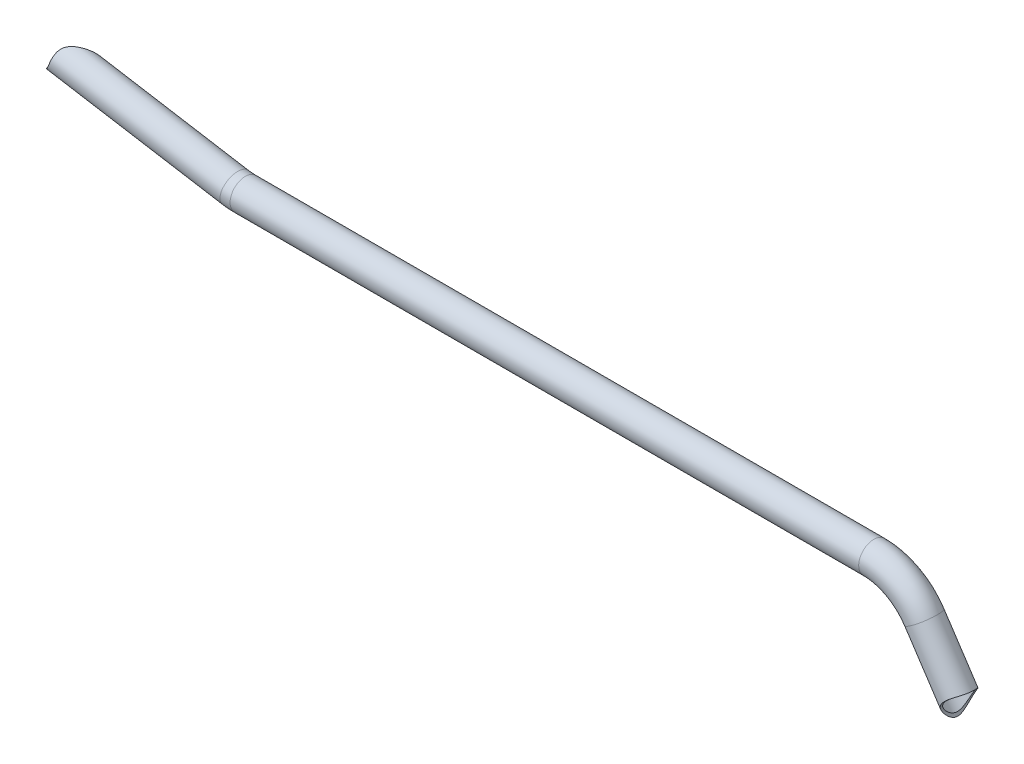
ISO-10303-21;
HEADER;
FILE_DESCRIPTION(('STEP AP214'),'2;1');
FILE_NAME('part.step','',(''),(''),'','','');
FILE_SCHEMA(('AUTOMOTIVE_DESIGN { 1 0 10303 214 1 1 1 1 }'));
ENDSEC;
DATA;
#1=APPLICATION_CONTEXT('core data for automotive mechanical design processes');
#2=APPLICATION_PROTOCOL_DEFINITION('international standard','automotive_design',2000,#1);
#3=PRODUCT_CONTEXT('',#1,'mechanical');
#4=PRODUCT('Part','Part','',(#3));
#5=PRODUCT_RELATED_PRODUCT_CATEGORY('part','',(#4));
#6=PRODUCT_DEFINITION_FORMATION('','',#4);
#7=PRODUCT_DEFINITION_CONTEXT('part definition',#1,'design');
#8=PRODUCT_DEFINITION('design','',#6,#7);
#9=PRODUCT_DEFINITION_SHAPE('','',#8);
#10=(LENGTH_UNIT() NAMED_UNIT(*) SI_UNIT(.MILLI.,.METRE.));
#11=(NAMED_UNIT(*) PLANE_ANGLE_UNIT() SI_UNIT($,.RADIAN.));
#12=(NAMED_UNIT(*) SI_UNIT($,.STERADIAN.) SOLID_ANGLE_UNIT());
#13=UNCERTAINTY_MEASURE_WITH_UNIT(LENGTH_MEASURE(1.E-05),#10,'distance_accuracy_value','');
#14=(GEOMETRIC_REPRESENTATION_CONTEXT(3) GLOBAL_UNCERTAINTY_ASSIGNED_CONTEXT((#13)) GLOBAL_UNIT_ASSIGNED_CONTEXT((#10,
#11,#12)) REPRESENTATION_CONTEXT('',''));
#15=CARTESIAN_POINT('',(0.,0.,0.));
#16=DIRECTION('',(0.,0.,1.));
#17=DIRECTION('',(1.,0.,0.));
#18=AXIS2_PLACEMENT_3D('',#15,#16,#17);
#19=CARTESIAN_POINT('',(397.792060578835,68.0988790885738,0.));
#20=DIRECTION('',(0.551647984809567,-0.834077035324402,0.));
#21=DIRECTION('',(0.834077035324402,0.551647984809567,0.));
#22=AXIS2_PLACEMENT_3D('',#19,#20,#21);
#23=CYLINDRICAL_SURFACE('',#22,15.);
#24=CARTESIAN_POINT('',(397.792060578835,68.0988790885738,0.));
#25=DIRECTION('',(-0.551647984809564,0.834077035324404,0.));
#26=DIRECTION('',(-0.834077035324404,-0.551647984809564,0.));
#27=AXIS2_PLACEMENT_3D('',#24,#25,#26);
#28=CIRCLE('',#27,15.);
#29=CARTESIAN_POINT('',(410.303216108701,76.3735988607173,0.));
#30=VERTEX_POINT('',#29);
#31=EDGE_CURVE('E62',#30,#30,#28,.T.);
#32=ORIENTED_EDGE('',*,*,#31,.F.);
#33=EDGE_LOOP('',(#32));
#34=FACE_BOUND('',#33,.T.);
#35=CARTESIAN_POINT('',(443.213872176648,26.6135649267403,0.));
#36=CARTESIAN_POINT('',(443.19452176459,26.6428207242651,0.423407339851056));
#37=CARTESIAN_POINT('',(443.159214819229,26.6636845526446,0.846683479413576));
#38=CARTESIAN_POINT('',(443.056723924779,26.6889290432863,1.69001068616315));
#39=CARTESIAN_POINT('',(442.989527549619,26.6933032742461,2.11006043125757));
#40=CARTESIAN_POINT('',(442.823628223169,26.6856436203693,2.94443805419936));
#41=CARTESIAN_POINT('',(442.724875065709,26.6735834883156,3.35875570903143));
#42=CARTESIAN_POINT('',(442.496841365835,26.6328972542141,4.17802479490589));
#43=CARTESIAN_POINT('',(442.367563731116,26.6042727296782,4.58297711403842));
#44=CARTESIAN_POINT('',(442.079961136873,26.5301741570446,5.38033383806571));
#45=CARTESIAN_POINT('',(441.921668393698,26.4847187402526,5.77275159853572));
#46=CARTESIAN_POINT('',(441.577604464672,26.3764265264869,6.54287795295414));
#47=CARTESIAN_POINT('',(441.39183254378,26.3135892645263,6.92058615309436));
#48=CARTESIAN_POINT('',(440.994820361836,26.1698369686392,7.65870971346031));
#49=CARTESIAN_POINT('',(440.783584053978,26.0889247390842,8.01912774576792));
#50=CARTESIAN_POINT('',(440.337877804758,25.9081612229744,8.72031910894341));
#51=CARTESIAN_POINT('',(440.103407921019,25.8083099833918,9.061092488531));
#52=CARTESIAN_POINT('',(439.612544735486,25.5881652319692,9.72229545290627));
#53=CARTESIAN_POINT('',(439.356048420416,25.4677727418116,10.042615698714));
#54=CARTESIAN_POINT('',(438.824984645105,25.2058810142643,10.6587410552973));
#55=CARTESIAN_POINT('',(438.550416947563,25.0643814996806,10.9545458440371));
#56=CARTESIAN_POINT('',(437.986415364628,24.7593450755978,11.5193129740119));
#57=CARTESIAN_POINT('',(437.696984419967,24.5958125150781,11.7882805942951));
#58=CARTESIAN_POINT('',(437.106677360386,24.2458847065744,12.297240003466));
#59=CARTESIAN_POINT('',(436.805801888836,24.05949074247,12.5372334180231));
#60=CARTESIAN_POINT('',(436.209336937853,23.6717314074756,12.9766622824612));
#61=CARTESIAN_POINT('',(435.914065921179,23.471338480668,13.1773876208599));
#62=CARTESIAN_POINT('',(435.320058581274,23.0489851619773,13.5488122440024));
#63=CARTESIAN_POINT('',(435.021322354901,22.827025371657,13.7195123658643));
#64=CARTESIAN_POINT('',(434.424323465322,22.3620065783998,14.029498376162));
#65=CARTESIAN_POINT('',(434.126060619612,22.1189616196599,14.1688049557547));
#66=CARTESIAN_POINT('',(433.533620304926,21.6124639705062,14.4152770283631));
#67=CARTESIAN_POINT('',(433.239442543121,21.3490127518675,14.522444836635));
#68=CARTESIAN_POINT('',(432.682511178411,20.8252617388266,14.6969068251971));
#69=CARTESIAN_POINT('',(432.41914815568,20.5664493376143,14.7667356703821));
#70=CARTESIAN_POINT('',(431.901676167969,20.0341115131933,14.8791662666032));
#71=CARTESIAN_POINT('',(431.647566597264,19.7605870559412,14.9217698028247));
#72=CARTESIAN_POINT('',(431.150986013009,19.200473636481,14.980335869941));
#73=CARTESIAN_POINT('',(430.908514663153,18.9138850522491,14.9962991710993));
#74=CARTESIAN_POINT('',(430.437198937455,18.329457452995,15.0025547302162));
#75=CARTESIAN_POINT('',(430.208354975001,18.0316180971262,14.9928462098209));
#76=CARTESIAN_POINT('',(429.766611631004,17.4276173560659,14.9491099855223));
#77=CARTESIAN_POINT('',(429.553661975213,17.12148678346,14.9151628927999));
#78=CARTESIAN_POINT('',(429.144004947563,16.5018656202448,14.8245337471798));
#79=CARTESIAN_POINT('',(428.947297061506,16.1883752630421,14.767852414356));
#80=CARTESIAN_POINT('',(428.570786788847,15.5557600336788,14.6333632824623));
#81=CARTESIAN_POINT('',(428.390988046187,15.2366339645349,14.5555509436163));
#82=CARTESIAN_POINT('',(428.048667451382,14.5944501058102,14.3804694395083));
#83=CARTESIAN_POINT('',(427.88614916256,14.2713915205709,14.2831962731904));
#84=CARTESIAN_POINT('',(427.513070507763,13.485027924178,14.0256959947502));
#85=CARTESIAN_POINT('',(427.311440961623,13.0204614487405,13.8562820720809));
#86=CARTESIAN_POINT('',(426.942773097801,12.0902349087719,13.4857503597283));
#87=CARTESIAN_POINT('',(426.775746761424,11.6245745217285,13.2846216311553));
#88=CARTESIAN_POINT('',(426.47469865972,10.6944112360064,12.8542005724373));
#89=CARTESIAN_POINT('',(426.340746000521,10.2299127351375,12.6248507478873));
#90=CARTESIAN_POINT('',(426.104613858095,9.3057021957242,12.1417084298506));
#91=CARTESIAN_POINT('',(426.00243429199,8.84599014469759,11.8879160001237));
#92=CARTESIAN_POINT('',(425.799507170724,7.78462448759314,11.2722367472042));
#93=CARTESIAN_POINT('',(425.710094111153,7.18557382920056,10.9020903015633));
#94=CARTESIAN_POINT('',(425.579359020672,6.00408958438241,10.1281220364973));
#95=CARTESIAN_POINT('',(425.538058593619,5.42166357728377,9.72428517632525));
#96=CARTESIAN_POINT('',(425.499192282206,4.27783270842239,8.88548663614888));
#97=CARTESIAN_POINT('',(425.501639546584,3.71643421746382,8.45051563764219));
#98=CARTESIAN_POINT('',(425.534888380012,2.89455476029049,7.77541863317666));
#99=CARTESIAN_POINT('',(425.550897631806,2.62399298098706,7.54663899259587));
#100=CARTESIAN_POINT('',(425.592227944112,2.09038834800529,7.08129685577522));
#101=CARTESIAN_POINT('',(425.617548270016,1.82734490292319,6.8447349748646));
#102=CARTESIAN_POINT('',(425.684043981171,1.24793997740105,6.30602367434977));
#103=CARTESIAN_POINT('',(425.72756202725,0.933853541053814,6.00170673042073));
#104=CARTESIAN_POINT('',(425.826907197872,0.321320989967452,5.37970826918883));
#105=CARTESIAN_POINT('',(425.88273194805,0.0228718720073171,5.06202933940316));
#106=CARTESIAN_POINT('',(426.005321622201,-0.554509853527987,4.41225476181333));
#107=CARTESIAN_POINT('',(426.072069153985,-0.833472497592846,4.08018264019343));
#108=CARTESIAN_POINT('',(426.21500743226,-1.36738253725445,3.39922933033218));
#109=CARTESIAN_POINT('',(426.29119379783,-1.62234097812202,3.05035598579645));
#110=CARTESIAN_POINT('',(426.418831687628,-2.00472165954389,2.4775391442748));
#111=CARTESIAN_POINT('',(426.467905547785,-2.14219195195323,2.2597917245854));
#112=CARTESIAN_POINT('',(426.568107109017,-2.4038157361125,1.81695536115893));
#113=CARTESIAN_POINT('',(426.619234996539,-2.52796801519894,1.59186575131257));
#114=CARTESIAN_POINT('',(426.774624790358,-2.87643334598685,0.905200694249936));
#115=CARTESIAN_POINT('',(426.881098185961,-3.07737474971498,0.431335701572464));
#116=CARTESIAN_POINT('',(427.027086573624,-3.2934679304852,-0.245018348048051));
#117=CARTESIAN_POINT('',(427.067549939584,-3.34691744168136,-0.435369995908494));
#118=CARTESIAN_POINT('',(427.147629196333,-3.43880651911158,-0.819804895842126));
#119=CARTESIAN_POINT('',(427.187245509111,-3.477253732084,-1.01388619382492));
#120=CARTESIAN_POINT('',(427.265054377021,-3.5376023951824,-1.40462985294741));
#121=CARTESIAN_POINT('',(427.303248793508,-3.55952625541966,-1.60128834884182));
#122=CARTESIAN_POINT('',(427.377779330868,-3.58575590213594,-1.9961491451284));
#123=CARTESIAN_POINT('',(427.414115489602,-3.59006204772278,-2.19435141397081));
#124=CARTESIAN_POINT('',(427.484708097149,-3.58043868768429,-2.59162581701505));
#125=CARTESIAN_POINT('',(427.51895431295,-3.56642598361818,-2.79069779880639));
#126=CARTESIAN_POINT('',(427.584972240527,-3.52012655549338,-3.18710861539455));
#127=CARTESIAN_POINT('',(427.616743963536,-3.48783991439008,-3.38444745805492));
#128=CARTESIAN_POINT('',(427.677838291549,-3.40574725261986,-3.77603507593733));
#129=CARTESIAN_POINT('',(427.70715825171,-3.35592260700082,-3.97028033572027));
#130=CARTESIAN_POINT('',(427.76350491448,-3.2400894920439,-4.35424505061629));
#131=CARTESIAN_POINT('',(427.790530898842,-3.17407597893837,-4.54396307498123));
#132=CARTESIAN_POINT('',(427.850825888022,-3.00439968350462,-4.97689726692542));
#133=CARTESIAN_POINT('',(427.883378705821,-2.89542796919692,-5.21813393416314));
#134=CARTESIAN_POINT('',(427.946062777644,-2.65624464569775,-5.69013638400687));
#135=CARTESIAN_POINT('',(427.976193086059,-2.52602480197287,-5.92089806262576));
#136=CARTESIAN_POINT('',(428.035145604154,-2.24768328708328,-6.37219188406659));
#137=CARTESIAN_POINT('',(428.063964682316,-2.09952156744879,-6.59269956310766));
#138=CARTESIAN_POINT('',(428.121221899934,-1.78857158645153,-7.02323699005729));
#139=CARTESIAN_POINT('',(428.149659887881,-1.62577769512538,-7.23326265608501));
#140=CARTESIAN_POINT('',(428.229401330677,-1.15669720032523,-7.80290214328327));
#141=CARTESIAN_POINT('',(428.281273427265,-0.837349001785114,-8.15170712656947));
#142=CARTESIAN_POINT('',(428.390734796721,-0.170816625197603,-8.8207011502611));
#143=CARTESIAN_POINT('',(428.448328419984,0.176388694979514,-9.14086805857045));
#144=CARTESIAN_POINT('',(428.572331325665,0.892507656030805,-9.75555119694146));
#145=CARTESIAN_POINT('',(428.638758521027,1.26146453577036,-10.0500132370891));
#146=CARTESIAN_POINT('',(428.782584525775,2.01562814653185,-10.6141257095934));
#147=CARTESIAN_POINT('',(428.859981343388,2.40083191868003,-10.8837806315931));
#148=CARTESIAN_POINT('',(429.056256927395,3.31843545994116,-11.4876510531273));
#149=CARTESIAN_POINT('',(429.180262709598,3.85604867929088,-11.8123315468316));
#150=CARTESIAN_POINT('',(429.454560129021,4.94845253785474,-12.4191935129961));
#151=CARTESIAN_POINT('',(429.604860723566,5.50324897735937,-12.7013604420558));
#152=CARTESIAN_POINT('',(429.933927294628,6.6242200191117,-13.221405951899));
#153=CARTESIAN_POINT('',(430.112654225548,7.19037809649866,-13.4593443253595));
#154=CARTESIAN_POINT('',(430.403305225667,8.04482469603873,-13.7812207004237));
#155=CARTESIAN_POINT('',(430.503938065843,8.33048032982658,-13.882666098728));
#156=CARTESIAN_POINT('',(430.712899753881,8.90310247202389,-14.0734982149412));
#157=CARTESIAN_POINT('',(430.821230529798,9.19006929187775,-14.1628818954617));
#158=CARTESIAN_POINT('',(431.112811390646,9.9365452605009,-14.3787893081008));
#159=CARTESIAN_POINT('',(431.302111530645,10.3965762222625,-14.4955432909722));
#160=CARTESIAN_POINT('',(431.700515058,11.3154210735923,-14.6945850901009));
#161=CARTESIAN_POINT('',(431.909614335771,11.7742351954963,-14.7768800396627));
#162=CARTESIAN_POINT('',(432.347134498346,12.6877009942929,-14.9045172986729));
#163=CARTESIAN_POINT('',(432.575550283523,13.1423537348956,-14.9498693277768));
#164=CARTESIAN_POINT('',(433.050684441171,14.0443381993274,-15.0010577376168));
#165=CARTESIAN_POINT('',(433.297403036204,14.4916698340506,-15.0068936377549));
#166=CARTESIAN_POINT('',(433.809644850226,15.3793789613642,-14.9764114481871));
#167=CARTESIAN_POINT('',(434.075316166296,15.8196588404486,-14.9397169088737));
#168=CARTESIAN_POINT('',(434.620832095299,16.6852214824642,-14.8213051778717));
#169=CARTESIAN_POINT('',(434.900676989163,17.1105039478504,-14.7395870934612));
#170=CARTESIAN_POINT('',(435.470751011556,17.9417295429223,-14.5295413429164));
#171=CARTESIAN_POINT('',(435.760971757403,18.3476876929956,-14.4012505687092));
#172=CARTESIAN_POINT('',(436.347564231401,19.1367155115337,-14.0971921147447));
#173=CARTESIAN_POINT('',(436.643934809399,19.5197894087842,-13.9214332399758));
#174=CARTESIAN_POINT('',(437.19406801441,20.205283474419,-13.5518875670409));
#175=CARTESIAN_POINT('',(437.447701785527,20.5112905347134,-13.3645299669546));
#176=CARTESIAN_POINT('',(437.952168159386,21.1023520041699,-12.9560704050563));
#177=CARTESIAN_POINT('',(438.203001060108,21.3874086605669,-12.7349720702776));
#178=CARTESIAN_POINT('',(438.698112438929,21.9351114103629,-12.2603341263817));
#179=CARTESIAN_POINT('',(438.942392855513,22.1977641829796,-12.0068042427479));
#180=CARTESIAN_POINT('',(439.420746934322,22.6998358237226,-11.4689813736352));
#181=CARTESIAN_POINT('',(439.654820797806,22.939255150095,-11.1846889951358));
#182=CARTESIAN_POINT('',(440.093540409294,23.3788202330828,-10.6079472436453));
#183=CARTESIAN_POINT('',(440.299103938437,23.5805320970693,-10.3173854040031));
#184=CARTESIAN_POINT('',(440.695335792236,23.9633525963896,-9.71345756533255));
#185=CARTESIAN_POINT('',(440.886004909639,24.1444623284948,-9.40009278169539));
#186=CARTESIAN_POINT('',(441.249847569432,24.4863898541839,-8.75261786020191));
#187=CARTESIAN_POINT('',(441.423014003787,24.6471994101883,-8.41849938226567));
#188=CARTESIAN_POINT('',(441.74928424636,24.9488971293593,-7.73197809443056));
#189=CARTESIAN_POINT('',(441.902387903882,25.0897851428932,-7.37957514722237));
#190=CARTESIAN_POINT('',(442.188967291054,25.3547318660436,-6.652125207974));
#191=CARTESIAN_POINT('',(442.322016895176,25.4784217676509,-6.2767759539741));
#192=CARTESIAN_POINT('',(442.562838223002,25.7064919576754,-5.51235132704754));
#193=CARTESIAN_POINT('',(442.670609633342,25.8108720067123,-5.12327578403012));
#194=CARTESIAN_POINT('',(442.858928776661,26.0009604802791,-4.33476217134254));
#195=CARTESIAN_POINT('',(442.939515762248,26.0866957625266,-3.93533994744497));
#196=CARTESIAN_POINT('',(443.07218626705,26.2404115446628,-3.12857641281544));
#197=CARTESIAN_POINT('',(443.124280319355,26.30839860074,-2.72123808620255));
#198=CARTESIAN_POINT('',(443.196391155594,26.4233331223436,-1.9290144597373));
#199=CARTESIAN_POINT('',(443.218331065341,26.4713887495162,-1.54446337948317));
#200=CARTESIAN_POINT('',(443.235905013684,26.5531496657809,-0.773238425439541));
#201=CARTESIAN_POINT('',(443.231538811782,26.5868548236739,-0.386564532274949));
#202=CARTESIAN_POINT('',(443.213872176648,26.6135649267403,0.));
#203=B_SPLINE_CURVE_WITH_KNOTS('',3,(#35,#36,#37,#38,#39,#40,#41,#42,#43,#44,#45,#46,#47,#48,
#49,#50,#51,#52,#53,#54,#55,#56,#57,#58,#59,#60,#61,#62,#63,#64,#65,#66,#67,#68,#69,#70,#71,#72,
#73,#74,#75,#76,#77,#78,#79,#80,#81,#82,#83,#84,#85,#86,#87,#88,#89,#90,#91,#92,#93,#94,#95,#96,
#97,#98,#99,#100,#101,#102,#103,#104,#105,#106,#107,#108,#109,#110,#111,#112,#113,#114,#115,
#116,#117,#118,#119,#120,#121,#122,#123,#124,#125,#126,#127,#128,#129,#130,#131,#132,#133,#134,
#135,#136,#137,#138,#139,#140,#141,#142,#143,#144,#145,#146,#147,#148,#149,#150,#151,#152,#153,
#154,#155,#156,#157,#158,#159,#160,#161,#162,#163,#164,#165,#166,#167,#168,#169,#170,#171,#172,
#173,#174,#175,#176,#177,#178,#179,#180,#181,#182,#183,#184,#185,#186,#187,#188,#189,#190,#191,
#192,#193,#194,#195,#196,#197,#198,#199,#200,#201,#202),.UNSPECIFIED.,.T.,.F.,(4,2,2,2,2,2,2,2,
2,2,2,2,2,2,2,2,2,2,2,2,2,2,2,2,2,2,2,2,2,2,2,2,2,2,2,2,2,2,2,2,2,2,2,2,2,2,2,2,2,2,2,2,2,2,2,2,
2,2,2,2,2,2,2,2,2,2,2,2,2,2,2,2,2,2,2,2,2,2,2,2,2,2,2,4),(0.,1.27422341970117,2.54894376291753,
3.82570234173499,5.10233934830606,6.37756735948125,7.65282948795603,8.92789389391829,
10.2029551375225,11.4843433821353,12.7657484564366,14.0469009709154,15.3279815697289,
16.5546376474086,17.7812595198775,19.0070705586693,20.2327932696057,21.3587945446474,
22.4847219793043,23.6106168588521,24.7365458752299,25.8587476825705,26.9809139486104,
28.1033214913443,29.2259600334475,30.8256431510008,32.4258792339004,34.029431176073,
35.6329789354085,37.759481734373,39.8869390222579,42.0150357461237,43.078852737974,
44.1425858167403,45.4604445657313,46.7780492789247,48.0935760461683,49.4084944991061,
50.1944900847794,50.9805571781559,52.5493907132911,53.154369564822,53.7590396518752,
54.3628881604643,54.9667243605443,55.5733125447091,56.1798979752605,56.787129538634,
57.3945505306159,58.1933702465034,58.9925002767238,59.793448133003,60.5947054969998,
62.0196269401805,63.445640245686,64.8745906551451,66.3032819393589,68.2214758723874,
70.140324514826,72.0565598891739,73.0144905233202,73.9726619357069,75.5040332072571,
77.0350873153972,78.5657384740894,80.0964082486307,81.6407305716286,83.1850835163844,
84.7282157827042,86.271062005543,87.5875280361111,88.903852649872,90.2197834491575,
91.5356882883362,92.7615987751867,93.9874439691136,95.2137850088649,96.4401352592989,
97.6896860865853,98.9392524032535,100.187006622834,101.434299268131,102.597635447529,
103.760982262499),.UNSPECIFIED.);
#204=CARTESIAN_POINT('',(443.213872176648,26.6135649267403,0.));
#205=VERTEX_POINT('',#204);
#206=EDGE_CURVE('E76',#205,#205,#203,.T.);
#207=ORIENTED_EDGE('',*,*,#206,.F.);
#208=EDGE_LOOP('',(#207));
#209=FACE_BOUND('',#208,.T.);
#210=ADVANCED_FACE('F33',(#34,#209),#23,.T.);
#211=CARTESIAN_POINT('',(397.792060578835,68.0988790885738,0.));
#212=DIRECTION('',(0.551647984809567,-0.834077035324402,0.));
#213=DIRECTION('',(0.834077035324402,0.551647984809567,0.));
#214=AXIS2_PLACEMENT_3D('',#211,#212,#213);
#215=CYLINDRICAL_SURFACE('',#214,13.);
#216=CARTESIAN_POINT('',(397.792060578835,68.0988790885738,0.));
#217=DIRECTION('',(-0.551647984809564,0.834077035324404,0.));
#218=DIRECTION('',(-0.834077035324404,-0.551647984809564,0.));
#219=AXIS2_PLACEMENT_3D('',#216,#217,#218);
#220=CIRCLE('',#219,13.);
#221=CARTESIAN_POINT('',(408.635062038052,75.2703028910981,0.));
#222=VERTEX_POINT('',#221);
#223=EDGE_CURVE('E92',#222,#222,#220,.T.);
#224=ORIENTED_EDGE('',*,*,#223,.T.);
#225=EDGE_LOOP('',(#224));
#226=FACE_BOUND('',#225,.T.);
#227=CARTESIAN_POINT('',(441.459033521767,25.6413337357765,0.));
#228=CARTESIAN_POINT('',(441.440237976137,25.6697504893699,0.367219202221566));
#229=CARTESIAN_POINT('',(441.408143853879,25.6900523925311,0.734403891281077));
#230=CARTESIAN_POINT('',(441.317407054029,25.7145985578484,1.46603439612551));
#231=CARTESIAN_POINT('',(441.258762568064,25.7188417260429,1.83048002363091));
#232=CARTESIAN_POINT('',(441.115303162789,25.7113168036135,2.55413863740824));
#233=CARTESIAN_POINT('',(441.030479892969,25.6995435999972,2.91334991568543));
#234=CARTESIAN_POINT('',(440.835404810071,25.6598927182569,3.6238853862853));
#235=CARTESIAN_POINT('',(440.725153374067,25.6320152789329,3.97520969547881));
#236=CARTESIAN_POINT('',(440.480285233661,25.559941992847,4.6674890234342));
#237=CARTESIAN_POINT('',(440.345671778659,25.515748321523,5.00844541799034));
#238=CARTESIAN_POINT('',(440.053406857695,25.4106955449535,5.67768623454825));
#239=CARTESIAN_POINT('',(439.895755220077,25.3498363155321,6.00597056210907));
#240=CARTESIAN_POINT('',(439.559013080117,25.2109913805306,6.64761566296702));
#241=CARTESIAN_POINT('',(439.379921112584,25.1330045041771,6.96097541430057));
#242=CARTESIAN_POINT('',(439.002176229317,24.9593678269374,7.57054879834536));
#243=CARTESIAN_POINT('',(438.803523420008,24.8637181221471,7.86676252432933));
#244=CARTESIAN_POINT('',(438.389450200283,24.6545137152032,8.43898523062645));
#245=CARTESIAN_POINT('',(438.174086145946,24.5410179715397,8.7150565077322));
#246=CARTESIAN_POINT('',(437.728383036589,24.2953347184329,9.24600185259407));
#247=CARTESIAN_POINT('',(437.498043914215,24.1631471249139,9.50087582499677));
#248=CARTESIAN_POINT('',(437.025067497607,23.8796355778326,9.9873858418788));
#249=CARTESIAN_POINT('',(436.782433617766,23.7283169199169,10.2190282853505));
#250=CARTESIAN_POINT('',(436.287677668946,23.4061923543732,10.6572878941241));
#251=CARTESIAN_POINT('',(436.035556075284,23.2353874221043,10.8639063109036));
#252=CARTESIAN_POINT('',(435.535803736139,22.8819092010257,11.2421970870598));
#253=CARTESIAN_POINT('',(435.288439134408,22.7000513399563,11.4149830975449));
#254=CARTESIAN_POINT('',(434.790734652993,22.3186129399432,11.7348046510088));
#255=CARTESIAN_POINT('',(434.540394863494,22.11903293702,11.8818409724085));
#256=CARTESIAN_POINT('',(434.039835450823,21.7027867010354,12.149115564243));
#257=CARTESIAN_POINT('',(433.78961582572,21.4861284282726,12.269366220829));
#258=CARTESIAN_POINT('',(433.292169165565,21.0365460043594,12.4825245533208));
#259=CARTESIAN_POINT('',(433.044941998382,20.8036225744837,12.5754334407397));
#260=CARTESIAN_POINT('',(432.571059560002,20.3372362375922,12.7289400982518));
#261=CARTESIAN_POINT('',(432.344061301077,20.1046483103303,12.7911450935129));
#262=CARTESIAN_POINT('',(431.897458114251,19.6275062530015,12.8914058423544));
#263=CARTESIAN_POINT('',(431.677852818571,19.38295271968,12.9294627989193));
#264=CARTESIAN_POINT('',(431.24799219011,18.8833555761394,12.9819463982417));
#265=CARTESIAN_POINT('',(431.03773653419,18.6283123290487,12.9963738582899));
#266=CARTESIAN_POINT('',(430.628202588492,18.1093100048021,13.0024208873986));
#267=CARTESIAN_POINT('',(430.42892468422,17.8453506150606,12.9940396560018));
#268=CARTESIAN_POINT('',(430.039540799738,17.3058456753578,12.9552181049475));
#269=CARTESIAN_POINT('',(429.849634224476,17.0301819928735,12.9244246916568));
#270=CARTESIAN_POINT('',(429.483505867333,16.4730463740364,12.8416794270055));
#271=CARTESIAN_POINT('',(429.307283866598,16.1915745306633,12.7897279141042));
#272=CARTESIAN_POINT('',(428.969092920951,15.6243038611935,12.6660371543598));
#273=CARTESIAN_POINT('',(428.807130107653,15.3385032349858,12.5942894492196));
#274=CARTESIAN_POINT('',(428.497860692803,14.764159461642,12.4324397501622));
#275=CARTESIAN_POINT('',(428.350556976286,14.4756157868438,12.3423341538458));
#276=CARTESIAN_POINT('',(428.014347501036,13.7806474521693,12.1054479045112));
#277=CARTESIAN_POINT('',(427.832575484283,13.3735430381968,11.9504561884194));
#278=CARTESIAN_POINT('',(427.497672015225,12.5599508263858,11.6106950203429));
#279=CARTESIAN_POINT('',(427.344550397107,12.1534632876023,11.425915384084));
#280=CARTESIAN_POINT('',(427.065847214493,11.3434967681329,11.0294914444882));
#281=CARTESIAN_POINT('',(426.940302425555,10.9400224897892,10.8178118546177));
#282=CARTESIAN_POINT('',(426.715749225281,10.1391726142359,10.3704283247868));
#283=CARTESIAN_POINT('',(426.616738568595,9.74179650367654,10.1347264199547));
#284=CARTESIAN_POINT('',(426.442426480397,8.94916200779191,9.63743020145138));
#285=CARTESIAN_POINT('',(426.367524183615,8.55403618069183,9.37548575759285));
#286=CARTESIAN_POINT('',(426.242008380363,7.77467752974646,8.83041238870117));
#287=CARTESIAN_POINT('',(426.191396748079,7.39044554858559,8.54728183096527));
#288=CARTESIAN_POINT('',(426.112872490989,6.6353122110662,7.96071144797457));
#289=CARTESIAN_POINT('',(426.084963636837,6.26441307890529,7.65726825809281));
#290=CARTESIAN_POINT('',(426.050285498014,5.53890297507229,7.03042027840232));
#291=CARTESIAN_POINT('',(426.043513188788,5.1842896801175,6.70701835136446));
#292=CARTESIAN_POINT('',(426.049081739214,4.54593599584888,6.08923994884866));
#293=CARTESIAN_POINT('',(426.058742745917,4.25947275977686,5.79764933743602));
#294=CARTESIAN_POINT('',(426.091274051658,3.7037865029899,5.19902960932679));
#295=CARTESIAN_POINT('',(426.11414605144,3.4345657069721,4.8919985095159));
#296=CARTESIAN_POINT('',(426.172008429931,2.9175839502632,4.26211672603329));
#297=CARTESIAN_POINT('',(426.206981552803,2.66979305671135,3.93928912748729));
#298=CARTESIAN_POINT('',(426.287882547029,2.20038523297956,3.27645699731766));
#299=CARTESIAN_POINT('',(426.333804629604,1.97875456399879,2.93646161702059));
#300=CARTESIAN_POINT('',(426.416282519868,1.64503233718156,2.36872014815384));
#301=CARTESIAN_POINT('',(426.449940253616,1.52292377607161,2.14642306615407));
#302=CARTESIAN_POINT('',(426.520616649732,1.29372432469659,1.69461412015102));
#303=CARTESIAN_POINT('',(426.557635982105,1.18663643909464,1.4651008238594));
#304=CARTESIAN_POINT('',(426.634504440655,0.990051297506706,0.999460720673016));
#305=CARTESIAN_POINT('',(426.674349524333,0.900529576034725,0.763343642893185));
#306=CARTESIAN_POINT('',(426.756354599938,0.741555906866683,0.284927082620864));
#307=CARTESIAN_POINT('',(426.79851310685,0.672091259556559,0.0426316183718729));
#308=CARTESIAN_POINT('',(426.877238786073,0.565693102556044,-0.405396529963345));
#309=CARTESIAN_POINT('',(426.913537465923,0.525236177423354,-0.610339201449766));
#310=CARTESIAN_POINT('',(426.986952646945,0.461274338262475,-1.0226397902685));
#311=CARTESIAN_POINT('',(427.024068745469,0.437761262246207,-1.22999649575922));
#312=CARTESIAN_POINT('',(427.098763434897,0.408707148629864,-1.64576816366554));
#313=CARTESIAN_POINT('',(427.136341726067,0.403155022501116,-1.85418239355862));
#314=CARTESIAN_POINT('',(427.211682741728,0.410553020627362,-2.27066076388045));
#315=CARTESIAN_POINT('',(427.249445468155,0.423503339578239,-2.47872490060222));
#316=CARTESIAN_POINT('',(427.32495704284,0.46790464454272,-2.89299972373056));
#317=CARTESIAN_POINT('',(427.362705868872,0.499366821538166,-3.09920921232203));
#318=CARTESIAN_POINT('',(427.438052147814,0.580199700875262,-3.50809687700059));
#319=CARTESIAN_POINT('',(427.475649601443,0.629570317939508,-3.71077506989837));
#320=CARTESIAN_POINT('',(427.55072902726,0.745187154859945,-4.11146290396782));
#321=CARTESIAN_POINT('',(427.588210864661,0.811448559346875,-4.30946816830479));
#322=CARTESIAN_POINT('',(427.663138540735,0.959420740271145,-4.69964488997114));
#323=CARTESIAN_POINT('',(427.70058436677,1.0411357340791,-4.89181473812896));
#324=CARTESIAN_POINT('',(427.78962902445,1.25154702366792,-5.34010372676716));
#325=CARTESIAN_POINT('',(427.841295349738,1.38639661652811,-5.59332931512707));
#326=CARTESIAN_POINT('',(427.945550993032,1.67823270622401,-6.08646782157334));
#327=CARTESIAN_POINT('',(427.998140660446,1.83522774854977,-6.32637555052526));
#328=CARTESIAN_POINT('',(428.105078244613,2.16804157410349,-6.79314034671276));
#329=CARTESIAN_POINT('',(428.159429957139,2.34390317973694,-7.01996584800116));
#330=CARTESIAN_POINT('',(428.270483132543,2.71099979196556,-7.46011163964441));
#331=CARTESIAN_POINT('',(428.327184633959,2.90223505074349,-7.67343170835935));
#332=CARTESIAN_POINT('',(428.474793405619,3.40331737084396,-8.19765977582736));
#333=CARTESIAN_POINT('',(428.567766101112,3.72186829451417,-8.4996937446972));
#334=CARTESIAN_POINT('',(428.762992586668,4.38195093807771,-9.07426893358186));
#335=CARTESIAN_POINT('',(428.86525113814,4.72349442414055,-9.34679486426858));
#336=CARTESIAN_POINT('',(429.080820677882,5.42445441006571,-9.86345625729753));
#337=CARTESIAN_POINT('',(429.194139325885,5.78388321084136,-10.1075717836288));
#338=CARTESIAN_POINT('',(429.433133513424,6.51627044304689,-10.5676351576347));
#339=CARTESIAN_POINT('',(429.558807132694,6.88922676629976,-10.7835873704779));
#340=CARTESIAN_POINT('',(429.828648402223,7.6598253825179,-11.1949906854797));
#341=CARTESIAN_POINT('',(429.973337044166,8.05786731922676,-11.3893521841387));
#342=CARTESIAN_POINT('',(430.278121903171,8.86192324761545,-11.7470933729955));
#343=CARTESIAN_POINT('',(430.438218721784,9.26793755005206,-11.9104718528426));
#344=CARTESIAN_POINT('',(430.774363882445,10.0849742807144,-12.2050804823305));
#345=CARTESIAN_POINT('',(430.950410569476,10.4959961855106,-12.336313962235));
#346=CARTESIAN_POINT('',(431.318659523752,11.3202227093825,-12.5650935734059));
#347=CARTESIAN_POINT('',(431.510862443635,11.7334274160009,-12.6626383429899));
#348=CARTESIAN_POINT('',(431.927653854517,12.5930278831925,-12.8287201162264));
#349=CARTESIAN_POINT('',(432.153605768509,13.0393593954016,-12.894212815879));
#350=CARTESIAN_POINT('',(432.62315872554,13.9271401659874,-12.980908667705));
#351=CARTESIAN_POINT('',(432.866761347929,14.3685889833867,-13.0021078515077));
#352=CARTESIAN_POINT('',(433.36949485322,15.2418821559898,-12.9975638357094));
#353=CARTESIAN_POINT('',(433.628612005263,15.6737345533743,-12.9718615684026));
#354=CARTESIAN_POINT('',(434.159652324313,16.5235977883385,-12.8712225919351));
#355=CARTESIAN_POINT('',(434.431572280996,16.9416120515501,-12.796298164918));
#356=CARTESIAN_POINT('',(434.94341348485,17.6987370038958,-12.6103468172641));
#357=CARTESIAN_POINT('',(435.182129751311,18.0403834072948,-12.5062857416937));
#358=CARTESIAN_POINT('',(435.662936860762,18.7074352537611,-12.2606112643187));
#359=CARTESIAN_POINT('',(435.905027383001,19.0328422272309,-12.119001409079));
#360=CARTESIAN_POINT('',(436.388853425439,19.6645327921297,-11.7984068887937));
#361=CARTESIAN_POINT('',(436.630589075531,19.97083082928,-11.6194509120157));
#362=CARTESIAN_POINT('',(437.109956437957,20.5622548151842,-11.2248360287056));
#363=CARTESIAN_POINT('',(437.347588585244,20.8473830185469,-11.0091810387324));
#364=CARTESIAN_POINT('',(437.784244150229,21.3590641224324,-10.5729330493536));
#365=CARTESIAN_POINT('',(437.984275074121,21.5884160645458,-10.3566150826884));
#366=CARTESIAN_POINT('',(438.375277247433,22.02878243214,-9.89864773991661));
#367=CARTESIAN_POINT('',(438.566249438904,22.2397987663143,-9.6570010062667));
#368=CARTESIAN_POINT('',(438.936372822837,22.6428901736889,-9.15005490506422));
#369=CARTESIAN_POINT('',(439.115524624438,22.8349662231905,-8.88475675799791));
#370=CARTESIAN_POINT('',(439.459362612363,23.1998842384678,-8.33244302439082));
#371=CARTESIAN_POINT('',(439.624048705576,23.3727260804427,-8.04542729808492));
#372=CARTESIAN_POINT('',(439.931855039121,23.6943186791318,-7.46059290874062));
#373=CARTESIAN_POINT('',(440.0754668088,23.8436281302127,-7.16333956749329));
#374=CARTESIAN_POINT('',(440.344597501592,24.1242169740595,-6.55258256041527));
#375=CARTESIAN_POINT('',(440.470116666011,24.2554966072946,-6.23907911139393));
#376=CARTESIAN_POINT('',(440.701139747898,24.5002780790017,-5.59817376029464));
#377=CARTESIAN_POINT('',(440.806648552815,24.613784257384,-5.27077527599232));
#378=CARTESIAN_POINT('',(440.996030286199,24.823429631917,-4.60437709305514));
#379=CARTESIAN_POINT('',(441.079904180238,24.9195696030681,-4.26537791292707));
#380=CARTESIAN_POINT('',(441.218903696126,25.0879719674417,-3.60538841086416));
#381=CARTESIAN_POINT('',(441.275777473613,25.161520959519,-3.28509222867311));
#382=CARTESIAN_POINT('',(441.369137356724,25.2946047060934,-2.63854827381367));
#383=CARTESIAN_POINT('',(441.40561651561,25.3541346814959,-2.31229851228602));
#384=CARTESIAN_POINT('',(441.457489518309,25.4594561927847,-1.65592176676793));
#385=CARTESIAN_POINT('',(441.472882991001,25.5052474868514,-1.32579471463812));
#386=CARTESIAN_POINT('',(441.482144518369,25.583343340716,-0.663768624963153));
#387=CARTESIAN_POINT('',(441.476019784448,25.6156524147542,-0.331870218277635));
#388=CARTESIAN_POINT('',(441.459033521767,25.6413337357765,0.));
#389=B_SPLINE_CURVE_WITH_KNOTS('',3,(#227,#228,#229,#230,#231,#232,#233,#234,#235,#236,#237,
#238,#239,#240,#241,#242,#243,#244,#245,#246,#247,#248,#249,#250,#251,#252,#253,#254,#255,#256,
#257,#258,#259,#260,#261,#262,#263,#264,#265,#266,#267,#268,#269,#270,#271,#272,#273,#274,#275,
#276,#277,#278,#279,#280,#281,#282,#283,#284,#285,#286,#287,#288,#289,#290,#291,#292,#293,#294,
#295,#296,#297,#298,#299,#300,#301,#302,#303,#304,#305,#306,#307,#308,#309,#310,#311,#312,#313,
#314,#315,#316,#317,#318,#319,#320,#321,#322,#323,#324,#325,#326,#327,#328,#329,#330,#331,#332,
#333,#334,#335,#336,#337,#338,#339,#340,#341,#342,#343,#344,#345,#346,#347,#348,#349,#350,#351,
#352,#353,#354,#355,#356,#357,#358,#359,#360,#361,#362,#363,#364,#365,#366,#367,#368,#369,#370,
#371,#372,#373,#374,#375,#376,#377,#378,#379,#380,#381,#382,#383,#384,#385,#386,#387,#388),
.UNSPECIFIED.,.T.,.F.,(4,2,2,2,2,2,2,2,2,2,2,2,2,2,2,2,2,2,2,2,2,2,2,2,2,2,2,2,2,2,2,2,2,2,2,2,
2,2,2,2,2,2,2,2,2,2,2,2,2,2,2,2,2,2,2,2,2,2,2,2,2,2,2,2,2,2,2,2,2,2,2,2,2,2,2,2,2,2,2,2,4),(0.,
1.10609222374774,2.21225979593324,3.31878057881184,4.42528495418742,5.53164185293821,
6.63800699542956,7.74444778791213,8.85088256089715,9.95373593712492,11.0565942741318,
12.1591479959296,13.2616465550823,14.3171842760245,15.3726900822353,16.427706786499,
17.4826767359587,18.4741973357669,19.4656685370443,20.4571054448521,21.4485771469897,
22.456016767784,23.4634402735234,24.4712948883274,25.4793474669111,26.8933302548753,
28.3077975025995,29.7241397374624,31.1403620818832,32.5789508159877,34.0176505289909,
35.456589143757,36.8953218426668,38.1211688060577,39.3471736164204,40.5714373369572,
41.7950552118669,42.562135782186,43.3293695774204,44.0955270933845,44.8611984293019,
45.4966497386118,46.1317947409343,46.7665475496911,47.4013070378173,48.0364506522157,
48.6715912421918,49.3073048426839,49.9431921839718,50.8163474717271,51.6898406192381,
52.5653600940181,53.4408939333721,54.7850127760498,56.1298247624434,57.4755748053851,
58.8211160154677,60.2177413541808,61.6144212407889,63.0109563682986,64.4075479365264,
65.9189632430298,67.4305139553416,68.9407461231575,70.4506015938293,71.7374771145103,
73.024231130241,74.3100003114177,75.5956323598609,76.7143742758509,77.8329995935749,
78.9515672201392,80.0701420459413,81.1558457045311,82.2415348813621,83.3269585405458,
84.4123337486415,85.4119293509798,86.4118652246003,87.4118186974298,88.4114370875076),.UNSPECIFIED.);
#390=CARTESIAN_POINT('',(441.459033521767,25.6413337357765,0.));
#391=VERTEX_POINT('',#390);
#392=EDGE_CURVE('E96',#391,#391,#389,.T.);
#393=ORIENTED_EDGE('',*,*,#392,.T.);
#394=EDGE_LOOP('',(#393));
#395=FACE_BOUND('',#394,.T.);
#396=ADVANCED_FACE('F101',(#226,#395),#215,.F.);
#397=CARTESIAN_POINT('',(347.747438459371,35.,0.));
#398=DIRECTION('',(0.,0.,-1.));
#399=DIRECTION('',(-1.,0.,0.));
#400=AXIS2_PLACEMENT_3D('',#397,#398,#399);
#401=TOROIDAL_SURFACE('',#400,60.,15.);
#402=CARTESIAN_POINT('',(347.74743845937,95.,0.));
#403=DIRECTION('',(-1.,0.,0.));
#404=DIRECTION('',(0.,-1.,0.));
#405=AXIS2_PLACEMENT_3D('',#402,#403,#404);
#406=CIRCLE('',#405,15.);
#407=CARTESIAN_POINT('',(347.74743845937,110.,0.));
#408=VERTEX_POINT('',#407);
#409=EDGE_CURVE('E89',#408,#408,#406,.T.);
#410=CARTESIAN_POINT('',(347.747438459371,35.,0.));
#411=DIRECTION('',(0.,0.,-1.));
#412=DIRECTION('',(-1.,0.,0.));
#413=AXIS2_PLACEMENT_3D('',#410,#411,#412);
#414=CIRCLE('',#413,75.);
#415=EDGE_CURVE('',#408,#30,#414,.T.);
#416=ORIENTED_EDGE('',*,*,#409,.F.);
#417=ORIENTED_EDGE('',*,*,#31,.T.);
#418=ORIENTED_EDGE('',*,*,#415,.T.);
#419=ORIENTED_EDGE('',*,*,#415,.F.);
#420=EDGE_LOOP('',(#416,#418,#417,#419));
#421=FACE_BOUND('',#420,.T.);
#422=ADVANCED_FACE('F140',(#421),#401,.T.);
#423=CARTESIAN_POINT('',(347.747438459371,35.,0.));
#424=DIRECTION('',(0.,0.,-1.));
#425=DIRECTION('',(-1.,0.,0.));
#426=AXIS2_PLACEMENT_3D('',#423,#424,#425);
#427=TOROIDAL_SURFACE('',#426,60.,13.);
#428=CARTESIAN_POINT('',(347.74743845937,95.,0.));
#429=DIRECTION('',(-1.,0.,0.));
#430=DIRECTION('',(0.,-1.,0.));
#431=AXIS2_PLACEMENT_3D('',#428,#429,#430);
#432=CIRCLE('',#431,13.);
#433=CARTESIAN_POINT('',(347.74743845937,108.,0.));
#434=VERTEX_POINT('',#433);
#435=EDGE_CURVE('E86',#434,#434,#432,.T.);
#436=CARTESIAN_POINT('',(347.747438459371,35.,0.));
#437=DIRECTION('',(0.,0.,-1.));
#438=DIRECTION('',(-1.,0.,0.));
#439=AXIS2_PLACEMENT_3D('',#436,#437,#438);
#440=CIRCLE('',#439,73.);
#441=EDGE_CURVE('',#434,#222,#440,.T.);
#442=ORIENTED_EDGE('',*,*,#435,.T.);
#443=ORIENTED_EDGE('',*,*,#223,.F.);
#444=ORIENTED_EDGE('',*,*,#441,.T.);
#445=ORIENTED_EDGE('',*,*,#441,.F.);
#446=EDGE_LOOP('',(#442,#444,#443,#445));
#447=FACE_BOUND('',#446,.T.);
#448=ADVANCED_FACE('F136',(#447),#427,.F.);
#449=CARTESIAN_POINT('',(-275.034248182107,95.,0.));
#450=DIRECTION('',(1.,0.,0.));
#451=DIRECTION('',(0.,1.,0.));
#452=AXIS2_PLACEMENT_3D('',#449,#450,#451);
#453=CYLINDRICAL_SURFACE('',#452,15.);
#454=CARTESIAN_POINT('',(-275.034248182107,95.,0.));
#455=DIRECTION('',(-1.,0.,0.));
#456=DIRECTION('',(0.,-1.,0.));
#457=AXIS2_PLACEMENT_3D('',#454,#455,#456);
#458=CIRCLE('',#457,15.);
#459=CARTESIAN_POINT('',(-275.034248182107,80.,0.));
#460=VERTEX_POINT('',#459);
#461=EDGE_CURVE('E83',#460,#460,#458,.T.);
#462=ORIENTED_EDGE('',*,*,#461,.F.);
#463=EDGE_LOOP('',(#462));
#464=FACE_BOUND('',#463,.T.);
#465=ORIENTED_EDGE('',*,*,#409,.T.);
#466=EDGE_LOOP('',(#465));
#467=FACE_BOUND('',#466,.T.);
#468=ADVANCED_FACE('F133',(#464,#467),#453,.T.);
#469=CARTESIAN_POINT('',(-275.034248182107,95.,0.));
#470=DIRECTION('',(1.,0.,0.));
#471=DIRECTION('',(0.,1.,0.));
#472=AXIS2_PLACEMENT_3D('',#469,#470,#471);
#473=CYLINDRICAL_SURFACE('',#472,13.);
#474=CARTESIAN_POINT('',(-275.034248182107,95.,0.));
#475=DIRECTION('',(-1.,0.,0.));
#476=DIRECTION('',(0.,-1.,0.));
#477=AXIS2_PLACEMENT_3D('',#474,#475,#476);
#478=CIRCLE('',#477,13.);
#479=CARTESIAN_POINT('',(-275.034248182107,82.,0.));
#480=VERTEX_POINT('',#479);
#481=EDGE_CURVE('E80',#480,#480,#478,.T.);
#482=ORIENTED_EDGE('',*,*,#481,.T.);
#483=EDGE_LOOP('',(#482));
#484=FACE_BOUND('',#483,.T.);
#485=ORIENTED_EDGE('',*,*,#435,.F.);
#486=EDGE_LOOP('',(#485));
#487=FACE_BOUND('',#486,.T.);
#488=ADVANCED_FACE('F129',(#484,#487),#473,.F.);
#489=CARTESIAN_POINT('',(-275.034248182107,155.,0.));
#490=DIRECTION('',(0.,0.,1.));
#491=DIRECTION('',(1.,0.,0.));
#492=AXIS2_PLACEMENT_3D('',#489,#490,#491);
#493=TOROIDAL_SURFACE('',#492,60.,15.);
#494=CARTESIAN_POINT('',(-284.898187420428,95.8163645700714,0.));
#495=DIRECTION('',(-0.986393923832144,0.164398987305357,0.));
#496=DIRECTION('',(-0.164398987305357,-0.986393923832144,0.));
#497=AXIS2_PLACEMENT_3D('',#494,#495,#496);
#498=CIRCLE('',#497,15.);
#499=CARTESIAN_POINT('',(-287.364172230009,81.0204557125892,0.));
#500=VERTEX_POINT('',#499);
#501=EDGE_CURVE('E74',#500,#500,#498,.T.);
#502=CARTESIAN_POINT('',(-275.034248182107,155.,0.));
#503=DIRECTION('',(0.,0.,1.));
#504=DIRECTION('',(1.,0.,0.));
#505=AXIS2_PLACEMENT_3D('',#502,#503,#504);
#506=CIRCLE('',#505,75.);
#507=EDGE_CURVE('',#500,#460,#506,.T.);
#508=ORIENTED_EDGE('',*,*,#501,.F.);
#509=ORIENTED_EDGE('',*,*,#461,.T.);
#510=ORIENTED_EDGE('',*,*,#507,.T.);
#511=ORIENTED_EDGE('',*,*,#507,.F.);
#512=EDGE_LOOP('',(#508,#510,#509,#511));
#513=FACE_BOUND('',#512,.T.);
#514=ADVANCED_FACE('F125',(#513),#493,.T.);
#515=CARTESIAN_POINT('',(-275.034248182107,155.,0.));
#516=DIRECTION('',(0.,0.,1.));
#517=DIRECTION('',(1.,0.,0.));
#518=AXIS2_PLACEMENT_3D('',#515,#516,#517);
#519=TOROIDAL_SURFACE('',#518,60.,13.);
#520=CARTESIAN_POINT('',(-284.898187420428,95.8163645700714,0.));
#521=DIRECTION('',(-0.986393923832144,0.164398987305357,0.));
#522=DIRECTION('',(-0.164398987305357,-0.986393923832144,0.));
#523=AXIS2_PLACEMENT_3D('',#520,#521,#522);
#524=CIRCLE('',#523,13.);
#525=CARTESIAN_POINT('',(-287.035374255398,82.9932435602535,0.));
#526=VERTEX_POINT('',#525);
#527=EDGE_CURVE('E70',#526,#526,#524,.T.);
#528=CARTESIAN_POINT('',(-275.034248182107,155.,0.));
#529=DIRECTION('',(0.,0.,1.));
#530=DIRECTION('',(1.,0.,0.));
#531=AXIS2_PLACEMENT_3D('',#528,#529,#530);
#532=CIRCLE('',#531,73.);
#533=EDGE_CURVE('',#526,#480,#532,.T.);
#534=ORIENTED_EDGE('',*,*,#527,.T.);
#535=ORIENTED_EDGE('',*,*,#481,.F.);
#536=ORIENTED_EDGE('',*,*,#533,.T.);
#537=ORIENTED_EDGE('',*,*,#533,.F.);
#538=EDGE_LOOP('',(#534,#536,#535,#537));
#539=FACE_BOUND('',#538,.T.);
#540=ADVANCED_FACE('F128',(#539),#519,.F.);
#541=CARTESIAN_POINT('',(-284.898187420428,95.8163645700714,0.));
#542=DIRECTION('',(-0.986393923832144,0.164398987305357,0.));
#543=DIRECTION('',(-0.164398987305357,-0.986393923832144,0.));
#544=AXIS2_PLACEMENT_3D('',#541,#542,#543);
#545=CYLINDRICAL_SURFACE('',#544,13.);
#546=ORIENTED_EDGE('',*,*,#527,.F.);
#547=EDGE_LOOP('',(#546));
#548=FACE_BOUND('',#547,.T.);
#549=CARTESIAN_POINT('',(-460.,125.,0.));
#550=DIRECTION('',(-0.986393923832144,0.164398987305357,0.));
#551=DIRECTION('',(-0.164398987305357,-0.986393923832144,0.));
#552=AXIS2_PLACEMENT_3D('',#549,#550,#551);
#553=CIRCLE('',#552,13.);
#554=CARTESIAN_POINT('',(-461.385629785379,116.686221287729,-9.8975306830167));
#555=VERTEX_POINT('',#554);
#556=CARTESIAN_POINT('',(-461.831792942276,114.009242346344,6.69684857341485));
#557=VERTEX_POINT('',#556);
#558=EDGE_CURVE('E71',#555,#557,#553,.T.);
#559=ORIENTED_EDGE('',*,*,#558,.T.);
#560=CARTESIAN_POINT('',(-461.831792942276,114.009242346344,6.69684857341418));
#561=CARTESIAN_POINT('',(-461.667917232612,114.05614018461,6.81866654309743));
#562=CARTESIAN_POINT('',(-461.506347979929,114.107121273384,6.94198196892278));
#563=CARTESIAN_POINT('',(-461.187601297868,114.217222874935,7.19059415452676));
#564=CARTESIAN_POINT('',(-461.03042326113,114.276342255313,7.31589063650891));
#565=CARTESIAN_POINT('',(-460.720254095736,114.402681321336,7.56743582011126));
#566=CARTESIAN_POINT('',(-460.567261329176,114.46989778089,7.69368412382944));
#567=CARTESIAN_POINT('',(-460.265183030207,114.612390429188,7.94629329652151));
#568=CARTESIAN_POINT('',(-460.116097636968,114.687666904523,8.07265416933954));
#569=CARTESIAN_POINT('',(-459.674076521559,114.925661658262,8.45093390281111));
#570=CARTESIAN_POINT('',(-459.386645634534,115.100434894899,8.70182757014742));
#571=CARTESIAN_POINT('',(-458.825349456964,115.481205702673,9.19489412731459));
#572=CARTESIAN_POINT('',(-458.5514850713,115.687205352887,9.43706643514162));
#573=CARTESIAN_POINT('',(-458.016349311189,116.129367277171,9.9077349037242));
#574=CARTESIAN_POINT('',(-457.75508284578,116.365541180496,10.1362257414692));
#575=CARTESIAN_POINT('',(-457.244780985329,116.866437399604,10.5748574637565));
#576=CARTESIAN_POINT('',(-456.995745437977,117.131159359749,10.784998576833));
#577=CARTESIAN_POINT('',(-456.509962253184,117.686829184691,11.1825550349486));
#578=CARTESIAN_POINT('',(-456.273199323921,117.977743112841,11.3699990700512));
#579=CARTESIAN_POINT('',(-455.81151354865,118.583651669,11.7187447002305));
#580=CARTESIAN_POINT('',(-455.586590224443,118.898645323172,11.8800473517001));
#581=CARTESIAN_POINT('',(-455.155301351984,119.539683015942,12.168643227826));
#582=CARTESIAN_POINT('',(-454.948576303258,119.865079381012,12.2968376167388));
#583=CARTESIAN_POINT('',(-454.545997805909,120.532691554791,12.522967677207));
#584=CARTESIAN_POINT('',(-454.350144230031,120.874907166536,12.620903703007));
#585=CARTESIAN_POINT('',(-453.96895561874,121.572801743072,12.7843690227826));
#586=CARTESIAN_POINT('',(-453.783623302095,121.928484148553,12.8498899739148));
#587=CARTESIAN_POINT('',(-453.42300062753,122.64945183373,12.9468055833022));
#588=CARTESIAN_POINT('',(-453.247709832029,123.014736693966,12.9782017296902));
#589=CARTESIAN_POINT('',(-452.916499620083,123.728963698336,13.0049045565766));
#590=CARTESIAN_POINT('',(-452.760048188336,124.077584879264,13.0022475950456));
#591=CARTESIAN_POINT('',(-452.454312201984,124.776268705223,12.9652224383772));
#592=CARTESIAN_POINT('',(-452.305027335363,125.126331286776,12.930855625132));
#593=CARTESIAN_POINT('',(-452.012357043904,125.824299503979,12.8303250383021));
#594=CARTESIAN_POINT('',(-451.868970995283,126.172205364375,12.7641646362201));
#595=CARTESIAN_POINT('',(-451.586473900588,126.862302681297,12.6003807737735));
#596=CARTESIAN_POINT('',(-451.447362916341,127.204494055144,12.5027568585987));
#597=CARTESIAN_POINT('',(-451.171765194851,127.878865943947,12.2770337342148));
#598=CARTESIAN_POINT('',(-451.035273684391,128.211065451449,12.1489970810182));
#599=CARTESIAN_POINT('',(-450.762387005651,128.86262780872,11.8635248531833));
#600=CARTESIAN_POINT('',(-450.625991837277,129.181990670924,11.7060893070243));
#601=CARTESIAN_POINT('',(-450.350790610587,129.804383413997,11.3634548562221));
#602=CARTESIAN_POINT('',(-450.211984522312,130.107413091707,11.1782556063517));
#603=CARTESIAN_POINT('',(-449.929279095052,130.693728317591,10.7822364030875));
#604=CARTESIAN_POINT('',(-449.78537979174,130.977014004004,10.5714166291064));
#605=CARTESIAN_POINT('',(-449.489664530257,131.520818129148,10.1266854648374));
#606=CARTESIAN_POINT('',(-449.337842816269,131.78131963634,9.89275717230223));
#607=CARTESIAN_POINT('',(-449.023855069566,132.276407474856,9.40522678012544));
#608=CARTESIAN_POINT('',(-448.861689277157,132.510994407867,9.15162513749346));
#609=CARTESIAN_POINT('',(-448.525096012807,132.951692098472,8.62879353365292));
#610=CARTESIAN_POINT('',(-448.350679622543,133.15782810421,8.35957773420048));
#611=CARTESIAN_POINT('',(-447.988120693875,133.540276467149,7.80947873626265));
#612=CARTESIAN_POINT('',(-447.799978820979,133.716590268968,7.52859610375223));
#613=CARTESIAN_POINT('',(-447.421474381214,134.02892442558,6.97678436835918));
#614=CARTESIAN_POINT('',(-447.231951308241,134.166749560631,6.70629708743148));
#615=CARTESIAN_POINT('',(-446.840771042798,134.41587618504,6.16196498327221));
#616=CARTESIAN_POINT('',(-446.639114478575,134.527179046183,5.88812033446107));
#617=CARTESIAN_POINT('',(-446.224499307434,134.724284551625,5.33968793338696));
#618=CARTESIAN_POINT('',(-446.011536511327,134.810077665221,5.06509994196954));
#619=CARTESIAN_POINT('',(-445.575685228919,134.957592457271,4.51736256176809));
#620=CARTESIAN_POINT('',(-445.352795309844,135.019310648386,4.24421338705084));
#621=CARTESIAN_POINT('',(-444.783036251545,135.146122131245,3.5626069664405));
#622=CARTESIAN_POINT('',(-444.430764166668,135.196968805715,3.1559845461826));
#623=CARTESIAN_POINT('',(-443.712299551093,135.253922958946,2.35199366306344));
#624=CARTESIAN_POINT('',(-443.346099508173,135.260005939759,1.95463038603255));
#625=CARTESIAN_POINT('',(-442.603038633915,135.232698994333,1.16796968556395));
#626=CARTESIAN_POINT('',(-442.226135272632,135.199120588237,0.778719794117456));
#627=CARTESIAN_POINT('',(-441.467735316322,135.096373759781,0.00970262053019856));
#628=CARTESIAN_POINT('',(-441.08623925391,135.027209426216,-0.370065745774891));
#629=CARTESIAN_POINT('',(-440.438632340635,134.88216634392,-1.0070213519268));
#630=CARTESIAN_POINT('',(-440.172708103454,134.81472375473,-1.26636972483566));
#631=CARTESIAN_POINT('',(-439.641658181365,134.66457399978,-1.78149293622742));
#632=CARTESIAN_POINT('',(-439.376532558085,134.581865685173,-2.03726750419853));
#633=CARTESIAN_POINT('',(-438.848115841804,134.401473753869,-2.54581979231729));
#634=CARTESIAN_POINT('',(-438.584826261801,134.303779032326,-2.7985951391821));
#635=CARTESIAN_POINT('',(-438.061526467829,134.093551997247,-3.30133853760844));
#636=CARTESIAN_POINT('',(-437.801516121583,133.98102028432,-3.55130670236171));
#637=CARTESIAN_POINT('',(-437.287340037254,133.741538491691,-4.04758609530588));
#638=CARTESIAN_POINT('',(-437.033152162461,133.614660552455,-4.29390914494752));
#639=CARTESIAN_POINT('',(-436.530783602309,133.345641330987,-4.7844132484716));
#640=CARTESIAN_POINT('',(-436.282603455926,133.203498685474,-5.02859410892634));
#641=CARTESIAN_POINT('',(-435.794290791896,132.903495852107,-5.51467539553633));
#642=CARTESIAN_POINT('',(-435.554149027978,132.745654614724,-5.75657819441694));
#643=CARTESIAN_POINT('',(-435.083728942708,132.413255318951,-6.23839547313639));
#644=CARTESIAN_POINT('',(-434.853447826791,132.238702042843,-6.47831050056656));
#645=CARTESIAN_POINT('',(-434.466700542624,131.921981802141,-6.89060724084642));
#646=CARTESIAN_POINT('',(-434.307295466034,131.784043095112,-7.06348390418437));
#647=CARTESIAN_POINT('',(-433.996262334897,131.498206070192,-7.40800195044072));
#648=CARTESIAN_POINT('',(-433.844633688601,131.350308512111,-7.57964342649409));
#649=CARTESIAN_POINT('',(-433.550445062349,131.043784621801,-7.92166526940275));
#650=CARTESIAN_POINT('',(-433.407896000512,130.885145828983,-8.09204390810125));
#651=CARTESIAN_POINT('',(-433.133861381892,130.556671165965,-8.4309595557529));
#652=CARTESIAN_POINT('',(-433.002375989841,130.386835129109,-8.59949653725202));
#653=CARTESIAN_POINT('',(-432.751182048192,130.033270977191,-8.93614255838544));
#654=CARTESIAN_POINT('',(-432.631632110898,129.849401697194,-9.10422268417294));
#655=CARTESIAN_POINT('',(-432.408857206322,129.469022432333,-9.43706127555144));
#656=CARTESIAN_POINT('',(-432.305634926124,129.272510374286,-9.60181919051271));
#657=CARTESIAN_POINT('',(-432.119083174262,128.867155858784,-9.92630821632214));
#658=CARTESIAN_POINT('',(-432.035703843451,128.658345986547,-10.0860510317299));
#659=CARTESIAN_POINT('',(-431.892320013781,128.228305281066,-10.3991585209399));
#660=CARTESIAN_POINT('',(-431.832299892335,128.007082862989,-10.5525273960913));
#661=CARTESIAN_POINT('',(-431.755990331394,127.633620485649,-10.7979485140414));
#662=CARTESIAN_POINT('',(-431.731742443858,127.484633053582,-10.8925144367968));
#663=CARTESIAN_POINT('',(-431.695711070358,127.182556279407,-11.0773383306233));
#664=CARTESIAN_POINT('',(-431.683923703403,127.029468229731,-11.1675976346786));
#665=CARTESIAN_POINT('',(-431.673722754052,126.720099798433,-11.3429993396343));
#666=CARTESIAN_POINT('',(-431.675298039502,126.563822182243,-11.4281459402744));
#667=CARTESIAN_POINT('',(-431.69247491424,126.248986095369,-11.5926529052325));
#668=CARTESIAN_POINT('',(-431.708076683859,126.090427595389,-11.6720131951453));
#669=CARTESIAN_POINT('',(-431.753766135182,125.771536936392,-11.8246015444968));
#670=CARTESIAN_POINT('',(-431.783919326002,125.611199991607,-11.8978000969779));
#671=CARTESIAN_POINT('',(-431.858703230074,125.290817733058,-12.0370951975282));
#672=CARTESIAN_POINT('',(-431.90333391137,125.130772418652,-12.1031917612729));
#673=CARTESIAN_POINT('',(-432.006651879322,124.812250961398,-12.2279379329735));
#674=CARTESIAN_POINT('',(-432.065345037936,124.653775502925,-12.2865844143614));
#675=CARTESIAN_POINT('',(-432.195978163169,124.339687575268,-12.3962491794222));
#676=CARTESIAN_POINT('',(-432.267918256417,124.184075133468,-12.4472673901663));
#677=CARTESIAN_POINT('',(-432.420127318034,123.884334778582,-12.5394064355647));
#678=CARTESIAN_POINT('',(-432.499808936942,123.740019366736,-12.5808918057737));
#679=CARTESIAN_POINT('',(-432.669160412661,123.455535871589,-12.6572541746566));
#680=CARTESIAN_POINT('',(-432.758833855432,123.315369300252,-12.6921287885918));
#681=CARTESIAN_POINT('',(-433.0412162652,122.901894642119,-12.7872793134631));
#682=CARTESIAN_POINT('',(-433.247361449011,122.635468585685,-12.8381250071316));
#683=CARTESIAN_POINT('',(-433.654865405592,122.160636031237,-12.9120129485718));
#684=CARTESIAN_POINT('',(-433.852534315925,121.949435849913,-12.9380293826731));
#685=CARTESIAN_POINT('',(-434.263817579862,121.541637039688,-12.9762726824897));
#686=CARTESIAN_POINT('',(-434.477441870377,121.345047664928,-12.9884908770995));
#687=CARTESIAN_POINT('',(-434.917613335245,120.965597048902,-13.0011274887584));
#688=CARTESIAN_POINT('',(-435.144188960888,120.782768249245,-13.0015188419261));
#689=CARTESIAN_POINT('',(-435.607287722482,120.430345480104,-12.9922120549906));
#690=CARTESIAN_POINT('',(-435.843814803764,120.260756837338,-12.9825098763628));
#691=CARTESIAN_POINT('',(-436.304916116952,119.947380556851,-12.9556714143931));
#692=CARTESIAN_POINT('',(-436.528872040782,119.802618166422,-12.9392126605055));
#693=CARTESIAN_POINT('',(-436.98222337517,119.52274439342,-12.9000432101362));
#694=CARTESIAN_POINT('',(-437.211619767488,119.387634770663,-12.8773313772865));
#695=CARTESIAN_POINT('',(-437.906780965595,118.995594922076,-12.8010760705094));
#696=CARTESIAN_POINT('',(-438.379279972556,118.752112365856,-12.7394283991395));
#697=CARTESIAN_POINT('',(-439.338067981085,118.295717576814,-12.5997246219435));
#698=CARTESIAN_POINT('',(-439.824396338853,118.082905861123,-12.5216165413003));
#699=CARTESIAN_POINT('',(-440.805927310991,117.685105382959,-12.353179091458));
#700=CARTESIAN_POINT('',(-441.301126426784,117.500105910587,-12.2628544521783));
#701=CARTESIAN_POINT('',(-442.300670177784,117.154227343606,-12.0727526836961));
#702=CARTESIAN_POINT('',(-442.805046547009,116.993463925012,-11.9729337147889));
#703=CARTESIAN_POINT('',(-443.819356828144,116.694954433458,-11.7669504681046));
#704=CARTESIAN_POINT('',(-444.329291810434,116.55721288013,-11.6607849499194));
#705=CARTESIAN_POINT('',(-445.35449200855,116.303134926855,-11.4444990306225));
#706=CARTESIAN_POINT('',(-445.869764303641,116.186832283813,-11.334372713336));
#707=CARTESIAN_POINT('',(-446.904242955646,115.975048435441,-11.1128780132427));
#708=CARTESIAN_POINT('',(-447.423448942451,115.879565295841,-11.0015097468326));
#709=CARTESIAN_POINT('',(-448.465121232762,115.709229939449,-10.7803795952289));
#710=CARTESIAN_POINT('',(-448.987584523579,115.634360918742,-10.6706164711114));
#711=CARTESIAN_POINT('',(-450.036181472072,115.505588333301,-10.4558349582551));
#712=CARTESIAN_POINT('',(-450.562315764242,115.451688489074,-10.3508174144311));
#713=CARTESIAN_POINT('',(-451.617129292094,115.366295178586,-10.1498397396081));
#714=CARTESIAN_POINT('',(-452.145801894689,115.334759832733,-10.053862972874));
#715=CARTESIAN_POINT('',(-453.206331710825,115.296469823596,-9.87614998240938));
#716=CARTESIAN_POINT('',(-453.738187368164,115.289703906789,-9.79440730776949));
#717=CARTESIAN_POINT('',(-454.639064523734,115.302840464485,-9.67448064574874));
#718=CARTESIAN_POINT('',(-455.007435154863,115.3151235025,-9.63064971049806));
#719=CARTESIAN_POINT('',(-455.744789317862,115.35562072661,-9.5563288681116));
#720=CARTESIAN_POINT('',(-456.113772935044,115.383837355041,-9.52584100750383));
#721=CARTESIAN_POINT('',(-456.848009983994,115.458562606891,-9.48197861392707));
#722=CARTESIAN_POINT('',(-457.213269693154,115.5049235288,-9.46846951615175));
#723=CARTESIAN_POINT('',(-457.940621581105,115.619102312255,-9.46193580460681));
#724=CARTESIAN_POINT('',(-458.302715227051,115.686909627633,-9.46890113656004));
#725=CARTESIAN_POINT('',(-458.896471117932,115.819692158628,-9.50014343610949));
#726=CARTESIAN_POINT('',(-459.130084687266,115.877592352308,-9.51762823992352));
#727=CARTESIAN_POINT('',(-459.593042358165,116.004909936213,-9.56342254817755));
#728=CARTESIAN_POINT('',(-459.822387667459,116.074324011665,-9.59172894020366));
#729=CARTESIAN_POINT('',(-460.278440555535,116.226406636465,-9.6598529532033));
#730=CARTESIAN_POINT('',(-460.505070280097,116.309242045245,-9.69982135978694));
#731=CARTESIAN_POINT('',(-460.951168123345,116.487905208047,-9.79063975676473));
#732=CARTESIAN_POINT('',(-461.170628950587,116.583745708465,-9.84150045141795));
#733=CARTESIAN_POINT('',(-461.385629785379,116.686221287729,-9.89753068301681));
#734=B_SPLINE_CURVE_WITH_KNOTS('',3,(#560,#561,#562,#563,#564,#565,#566,#567,#568,#569,#570,
#571,#572,#573,#574,#575,#576,#577,#578,#579,#580,#581,#582,#583,#584,#585,#586,#587,#588,#589,
#590,#591,#592,#593,#594,#595,#596,#597,#598,#599,#600,#601,#602,#603,#604,#605,#606,#607,#608,
#609,#610,#611,#612,#613,#614,#615,#616,#617,#618,#619,#620,#621,#622,#623,#624,#625,#626,#627,
#628,#629,#630,#631,#632,#633,#634,#635,#636,#637,#638,#639,#640,#641,#642,#643,#644,#645,#646,
#647,#648,#649,#650,#651,#652,#653,#654,#655,#656,#657,#658,#659,#660,#661,#662,#663,#664,#665,
#666,#667,#668,#669,#670,#671,#672,#673,#674,#675,#676,#677,#678,#679,#680,#681,#682,#683,#684,
#685,#686,#687,#688,#689,#690,#691,#692,#693,#694,#695,#696,#697,#698,#699,#700,#701,#702,#703,
#704,#705,#706,#707,#708,#709,#710,#711,#712,#713,#714,#715,#716,#717,#718,#719,#720,#721,#722,
#723,#724,#725,#726,#727,#728,#729,#730,#731,#732,#733),.UNSPECIFIED.,.F.,.F.,(4,2,2,2,2,2,2,2,
2,2,2,2,2,2,2,2,2,2,2,2,2,2,2,2,2,2,2,2,2,2,2,2,2,2,2,2,2,2,2,2,2,2,2,2,2,2,2,2,2,2,2,2,2,2,2,2,
2,2,2,2,2,2,2,2,2,2,2,2,2,2,2,2,2,2,2,2,2,2,2,2,2,2,2,2,2,2,4),(0.,0.628442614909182,
1.25679787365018,1.884903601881,2.51303167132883,3.77038400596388,5.02782009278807,
6.28574226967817,7.54364877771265,8.79994826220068,10.0561969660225,11.2734033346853,
12.4905954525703,13.7081006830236,14.9255528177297,16.0705595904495,17.2155164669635,
18.3603519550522,19.5052039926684,20.6477212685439,21.7902374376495,22.9327678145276,
24.0752901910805,25.2186545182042,26.3619922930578,27.5043088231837,28.6465700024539,
29.7189739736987,30.7913224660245,31.8640710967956,32.9369750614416,34.5555273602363,
36.1749653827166,37.8021304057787,39.4291085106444,40.5613823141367,41.6937413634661,
42.8269435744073,43.9600999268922,45.0877923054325,46.215585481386,47.3420334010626,
48.4681599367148,49.2857750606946,50.1033278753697,50.9218459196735,51.7403761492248,
52.5686385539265,53.3970371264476,54.2233316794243,55.0490726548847,55.5829767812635,
56.116714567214,56.6500077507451,57.1833077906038,57.7190314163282,58.2547538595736,
58.7907003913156,59.3266520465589,59.8361157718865,60.3457629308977,61.3645615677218,
62.2347169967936,63.1054189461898,63.9781132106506,64.8511567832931,65.6523501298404,
66.4536891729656,68.0572231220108,69.6658983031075,71.2739524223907,72.889453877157,
74.5052721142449,76.1236132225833,77.7418039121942,79.3586715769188,80.9758259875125,
82.5899440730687,84.2033287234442,85.316388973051,86.4296198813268,87.5339710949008,
88.6377800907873,89.361244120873,90.0845002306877,90.8175568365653,91.5513371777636),.UNSPECIFIED.);
#735=EDGE_CURVE('E47',#557,#555,#734,.T.);
#736=ORIENTED_EDGE('',*,*,#735,.T.);
#737=EDGE_LOOP('',(#559,#736));
#738=FACE_BOUND('',#737,.T.);
#739=ADVANCED_FACE('F169',(#548,#738),#545,.F.);
#740=CARTESIAN_POINT('',(-284.898187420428,95.8163645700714,0.));
#741=DIRECTION('',(-0.986393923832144,0.164398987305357,0.));
#742=DIRECTION('',(-0.164398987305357,-0.986393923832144,0.));
#743=AXIS2_PLACEMENT_3D('',#740,#741,#742);
#744=CYLINDRICAL_SURFACE('',#743,15.);
#745=CARTESIAN_POINT('',(-461.728342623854,114.629944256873,10.6992885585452));
#746=CARTESIAN_POINT('',(-461.566615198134,114.71652533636,10.809337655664));
#747=CARTESIAN_POINT('',(-461.407157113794,114.807159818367,10.9194772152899));
#748=CARTESIAN_POINT('',(-461.092686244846,114.996423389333,11.13920814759));
#749=CARTESIAN_POINT('',(-460.937673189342,115.09505198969,11.2487995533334));
#750=CARTESIAN_POINT('',(-460.479221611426,115.402717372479,11.5756145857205));
#751=CARTESIAN_POINT('',(-460.182276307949,115.623584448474,11.7909441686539));
#752=CARTESIAN_POINT('',(-459.605204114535,116.095517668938,12.2111341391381));
#753=CARTESIAN_POINT('',(-459.325084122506,116.34659607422,12.4159902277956));
#754=CARTESIAN_POINT('',(-458.917375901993,116.744396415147,12.711699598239));
#755=CARTESIAN_POINT('',(-458.783547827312,116.880531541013,12.8083430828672));
#756=CARTESIAN_POINT('',(-458.519944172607,117.159666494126,12.9972752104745));
#757=CARTESIAN_POINT('',(-458.390169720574,117.302668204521,13.0895626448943));
#758=CARTESIAN_POINT('',(-458.006613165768,117.741879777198,13.3592769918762));
#759=CARTESIAN_POINT('',(-457.758888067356,118.048011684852,13.5293430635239));
#760=CARTESIAN_POINT('',(-457.279480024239,118.684085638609,13.8459303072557));
#761=CARTESIAN_POINT('',(-457.047796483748,119.014026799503,13.9924523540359));
#762=CARTESIAN_POINT('',(-456.712293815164,119.524364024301,14.1920153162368));
#763=CARTESIAN_POINT('',(-456.602501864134,119.696980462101,14.2551466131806));
#764=CARTESIAN_POINT('',(-456.38686030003,120.046980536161,14.3743408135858));
#765=CARTESIAN_POINT('',(-456.281009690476,120.224362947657,14.4304055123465));
#766=CARTESIAN_POINT('',(-455.969266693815,120.763135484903,14.5875104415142));
#767=CARTESIAN_POINT('',(-455.769149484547,121.131202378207,14.6774817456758));
#768=CARTESIAN_POINT('',(-455.389851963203,121.870094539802,14.8233207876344));
#769=CARTESIAN_POINT('',(-455.210223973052,122.240506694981,14.8801296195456));
#770=CARTESIAN_POINT('',(-454.864666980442,122.991100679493,14.962186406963));
#771=CARTESIAN_POINT('',(-454.698737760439,123.371282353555,14.9874348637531));
#772=CARTESIAN_POINT('',(-454.379771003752,124.137923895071,15.0052729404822));
#773=CARTESIAN_POINT('',(-454.226738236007,124.524386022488,14.997850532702));
#774=CARTESIAN_POINT('',(-453.932594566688,125.29975882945,14.9497037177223));
#775=CARTESIAN_POINT('',(-453.79148365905,125.688669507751,14.9089793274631));
#776=CARTESIAN_POINT('',(-453.521774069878,126.459672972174,14.7948873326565));
#777=CARTESIAN_POINT('',(-453.393025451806,126.841783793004,14.7219943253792));
#778=CARTESIAN_POINT('',(-453.144164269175,127.601253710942,14.5439357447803));
#779=CARTESIAN_POINT('',(-453.024051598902,127.978612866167,14.4387705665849));
#780=CARTESIAN_POINT('',(-452.79041642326,128.725250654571,14.1967261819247));
#781=CARTESIAN_POINT('',(-452.676896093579,129.09452659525,14.0598365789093));
#782=CARTESIAN_POINT('',(-452.454068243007,129.821487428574,13.7552917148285));
#783=CARTESIAN_POINT('',(-452.344760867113,130.179171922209,13.5876353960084));
#784=CARTESIAN_POINT('',(-452.123437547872,130.892710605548,13.2159844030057));
#785=CARTESIAN_POINT('',(-452.011473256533,131.24799572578,13.0108649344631));
#786=CARTESIAN_POINT('',(-451.785288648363,131.938777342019,12.5706732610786));
#787=CARTESIAN_POINT('',(-451.671068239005,132.274273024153,12.3355998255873));
#788=CARTESIAN_POINT('',(-451.43618768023,132.921614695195,11.8379238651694));
#789=CARTESIAN_POINT('',(-451.315529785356,133.233468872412,11.5753309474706));
#790=CARTESIAN_POINT('',(-451.063141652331,133.829895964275,11.0255753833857));
#791=CARTESIAN_POINT('',(-450.931411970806,134.114470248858,10.7384139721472));
#792=CARTESIAN_POINT('',(-450.654975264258,134.647404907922,10.1492960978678));
#793=CARTESIAN_POINT('',(-450.510575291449,134.89636863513,9.84774293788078));
#794=CARTESIAN_POINT('',(-450.202751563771,135.361548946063,9.22943610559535));
#795=CARTESIAN_POINT('',(-450.039329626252,135.577768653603,8.91268388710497));
#796=CARTESIAN_POINT('',(-449.690972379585,135.974983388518,8.26993281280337));
#797=CARTESIAN_POINT('',(-449.506073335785,136.15603645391,7.94395022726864));
#798=CARTESIAN_POINT('',(-449.11349511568,136.482555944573,7.28794330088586));
#799=CARTESIAN_POINT('',(-448.905817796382,136.628025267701,6.957919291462));
#800=CARTESIAN_POINT('',(-448.501024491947,136.865192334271,6.34794214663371));
#801=CARTESIAN_POINT('',(-448.306914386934,136.961666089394,6.06782608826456));
#802=CARTESIAN_POINT('',(-447.90421040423,137.130760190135,5.51091562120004));
#803=CARTESIAN_POINT('',(-447.695618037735,137.203383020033,5.23412086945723));
#804=CARTESIAN_POINT('',(-447.26556859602,137.326664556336,4.68525956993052));
#805=CARTESIAN_POINT('',(-447.044097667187,137.377299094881,4.41319853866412));
#806=CARTESIAN_POINT('',(-446.590514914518,137.458541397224,3.87502926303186));
#807=CARTESIAN_POINT('',(-446.3584017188,137.489146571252,3.60892179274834));
#808=CARTESIAN_POINT('',(-445.906284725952,137.530446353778,3.10608142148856));
#809=CARTESIAN_POINT('',(-445.687001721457,137.542650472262,2.86881759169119));
#810=CARTESIAN_POINT('',(-445.242610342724,137.553468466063,2.39944254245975));
#811=CARTESIAN_POINT('',(-445.017500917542,137.552079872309,2.16733226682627));
#812=CARTESIAN_POINT('',(-444.562570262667,137.536935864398,1.7078886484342));
#813=CARTESIAN_POINT('',(-444.332745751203,137.523171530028,1.48055887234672));
#814=CARTESIAN_POINT('',(-443.869634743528,137.484311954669,1.03048575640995));
#815=CARTESIAN_POINT('',(-443.636348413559,137.459217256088,0.807742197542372));
#816=CARTESIAN_POINT('',(-443.166043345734,137.398402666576,0.365274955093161));
#817=CARTESIAN_POINT('',(-442.929011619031,137.362629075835,0.14557255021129));
#818=CARTESIAN_POINT('',(-442.453201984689,137.281199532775,-0.290107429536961));
#819=CARTESIAN_POINT('',(-442.214423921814,137.235542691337,-0.506084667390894));
#820=CARTESIAN_POINT('',(-441.735976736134,137.134911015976,-0.934643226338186));
#821=CARTESIAN_POINT('',(-441.496308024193,137.079940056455,-1.14722591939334));
#822=CARTESIAN_POINT('',(-441.016636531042,136.961066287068,-1.5695026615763));
#823=CARTESIAN_POINT('',(-440.776633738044,136.897163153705,-1.77919660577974));
#824=CARTESIAN_POINT('',(-440.192073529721,136.730892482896,-2.28717465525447));
#825=CARTESIAN_POINT('',(-439.847659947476,136.623919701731,-2.58412661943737));
#826=CARTESIAN_POINT('',(-439.161095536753,136.392566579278,-3.17386149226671));
#827=CARTESIAN_POINT('',(-438.818944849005,136.268185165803,-3.46664414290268));
#828=CARTESIAN_POINT('',(-438.138240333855,136.001915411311,-4.04917097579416));
#829=CARTESIAN_POINT('',(-437.799690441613,135.860009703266,-4.33891183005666));
#830=CARTESIAN_POINT('',(-437.128286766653,135.558453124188,-4.91576066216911));
#831=CARTESIAN_POINT('',(-436.795432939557,135.398802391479,-5.20286866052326));
#832=CARTESIAN_POINT('',(-436.13827463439,135.061521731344,-5.77422036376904));
#833=CARTESIAN_POINT('',(-435.813949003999,134.88394290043,-6.05846980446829));
#834=CARTESIAN_POINT('',(-435.175158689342,134.509378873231,-6.62530459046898));
#835=CARTESIAN_POINT('',(-434.860693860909,134.312393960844,-6.90788996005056));
#836=CARTESIAN_POINT('',(-434.244970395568,133.897943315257,-7.47109297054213));
#837=CARTESIAN_POINT('',(-433.943688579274,133.680515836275,-7.75171327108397));
#838=CARTESIAN_POINT('',(-433.357202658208,133.222972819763,-8.31151740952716));
#839=CARTESIAN_POINT('',(-433.072000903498,132.982853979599,-8.59070103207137));
#840=CARTESIAN_POINT('',(-432.544671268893,132.498120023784,-9.12463054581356));
#841=CARTESIAN_POINT('',(-432.300925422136,132.255441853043,-9.37952544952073));
#842=CARTESIAN_POINT('',(-431.836032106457,131.747115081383,-9.88677173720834));
#843=CARTESIAN_POINT('',(-431.614869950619,131.48148161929,-10.1391246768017));
#844=CARTESIAN_POINT('',(-431.202621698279,130.926525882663,-10.6385905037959));
#845=CARTESIAN_POINT('',(-431.011373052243,130.637345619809,-10.8857249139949));
#846=CARTESIAN_POINT('',(-430.666213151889,130.032727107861,-11.3733315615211));
#847=CARTESIAN_POINT('',(-430.512250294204,129.717325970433,-11.6138125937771));
#848=CARTESIAN_POINT('',(-430.258375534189,129.074814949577,-12.073335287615));
#849=CARTESIAN_POINT('',(-430.156262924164,128.748952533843,-12.2928533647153));
#850=CARTESIAN_POINT('',(-430.04407464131,128.243942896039,-12.6106675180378));
#851=CARTESIAN_POINT('',(-430.01350565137,128.07285018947,-12.7147244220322));
#852=CARTESIAN_POINT('',(-429.967366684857,127.72596960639,-12.9181703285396));
#853=CARTESIAN_POINT('',(-429.95179005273,127.550183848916,-13.0175613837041));
#854=CARTESIAN_POINT('',(-429.936740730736,127.193160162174,-13.2117205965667));
#855=CARTESIAN_POINT('',(-429.937425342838,127.011885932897,-13.3064347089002));
#856=CARTESIAN_POINT('',(-429.956194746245,126.646894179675,-13.4892439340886));
#857=CARTESIAN_POINT('',(-429.974279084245,126.463176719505,-13.5773392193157));
#858=CARTESIAN_POINT('',(-430.028285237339,126.095030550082,-13.7459890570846));
#859=CARTESIAN_POINT('',(-430.064196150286,125.910602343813,-13.8265481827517));
#860=CARTESIAN_POINT('',(-430.153755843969,125.542674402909,-13.9794962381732));
#861=CARTESIAN_POINT('',(-430.207403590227,125.359174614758,-14.0518856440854));
#862=CARTESIAN_POINT('',(-430.325744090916,125.012486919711,-14.1814644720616));
#863=CARTESIAN_POINT('',(-430.388862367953,124.849054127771,-14.2394470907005));
#864=CARTESIAN_POINT('',(-430.528239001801,124.525394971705,-14.3483201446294));
#865=CARTESIAN_POINT('',(-430.604502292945,124.36516983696,-14.3992079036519));
#866=CARTESIAN_POINT('',(-430.769139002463,124.048884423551,-14.4939506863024));
#867=CARTESIAN_POINT('',(-430.85751543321,123.892825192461,-14.5378039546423));
#868=CARTESIAN_POINT('',(-431.045216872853,123.58558641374,-14.6187045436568));
#869=CARTESIAN_POINT('',(-431.144544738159,123.434408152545,-14.6557500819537));
#870=CARTESIAN_POINT('',(-431.396890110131,123.074832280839,-14.7376258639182));
#871=CARTESIAN_POINT('',(-431.5548943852,122.869167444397,-14.7791584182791));
#872=CARTESIAN_POINT('',(-431.887321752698,122.469437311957,-14.8503764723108));
#873=CARTESIAN_POINT('',(-432.061751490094,122.275376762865,-14.8800571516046));
#874=CARTESIAN_POINT('',(-432.605885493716,121.71012967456,-14.9534324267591));
#875=CARTESIAN_POINT('',(-432.996036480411,121.356424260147,-14.9813428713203));
#876=CARTESIAN_POINT('',(-433.748161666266,120.745215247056,-15.0032180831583));
#877=CARTESIAN_POINT('',(-434.105013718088,120.481315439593,-15.0018053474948));
#878=CARTESIAN_POINT('',(-434.837639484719,119.981552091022,-14.9810669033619));
#879=CARTESIAN_POINT('',(-435.213426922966,119.745709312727,-14.961728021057));
#880=CARTESIAN_POINT('',(-435.979496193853,119.299015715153,-14.9089657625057));
#881=CARTESIAN_POINT('',(-436.369806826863,119.088218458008,-14.8755128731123));
#882=CARTESIAN_POINT('',(-437.160991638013,118.689536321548,-14.7976213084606));
#883=CARTESIAN_POINT('',(-437.561869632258,118.501659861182,-14.7531786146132));
#884=CARTESIAN_POINT('',(-438.358686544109,118.152513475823,-14.6573936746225));
#885=CARTESIAN_POINT('',(-438.754370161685,117.990582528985,-14.6063190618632));
#886=CARTESIAN_POINT('',(-439.551753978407,117.684789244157,-14.4981493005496));
#887=CARTESIAN_POINT('',(-439.953453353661,117.540924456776,-14.4410549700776));
#888=CARTESIAN_POINT('',(-440.762239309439,117.269912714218,-14.3224297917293));
#889=CARTESIAN_POINT('',(-441.16933089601,117.14278269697,-14.2608945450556));
#890=CARTESIAN_POINT('',(-441.987722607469,116.90452215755,-14.1349290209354));
#891=CARTESIAN_POINT('',(-442.399022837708,116.793392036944,-14.0704986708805));
#892=CARTESIAN_POINT('',(-443.22570823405,116.586417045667,-13.9400767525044));
#893=CARTESIAN_POINT('',(-443.641097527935,116.490589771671,-13.8740834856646));
#894=CARTESIAN_POINT('',(-444.475060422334,116.314046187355,-13.7419969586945));
#895=CARTESIAN_POINT('',(-444.893634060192,116.233330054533,-13.6759036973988));
#896=CARTESIAN_POINT('',(-445.733352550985,116.087006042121,-13.5450875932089));
#897=CARTESIAN_POINT('',(-446.154495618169,116.021388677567,-13.4803639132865));
#898=CARTESIAN_POINT('',(-446.99927780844,115.905450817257,-13.3537739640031));
#899=CARTESIAN_POINT('',(-447.422916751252,115.855129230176,-13.2919074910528));
#900=CARTESIAN_POINT('',(-448.381049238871,115.759493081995,-13.1574490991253));
#901=CARTESIAN_POINT('',(-448.916194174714,115.718747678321,-13.0861587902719));
#902=CARTESIAN_POINT('',(-449.989306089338,115.664206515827,-12.9544701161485));
#903=CARTESIAN_POINT('',(-450.527273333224,115.650413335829,-12.8940727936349));
#904=CARTESIAN_POINT('',(-451.603420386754,115.652888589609,-12.7887416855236));
#905=CARTESIAN_POINT('',(-452.141596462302,115.669083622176,-12.7437704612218));
#906=CARTESIAN_POINT('',(-453.217161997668,115.735780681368,-12.6741727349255));
#907=CARTESIAN_POINT('',(-453.754551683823,115.786269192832,-12.649538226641));
#908=CARTESIAN_POINT('',(-454.672291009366,115.907172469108,-12.6293167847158));
#909=CARTESIAN_POINT('',(-455.053784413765,115.967819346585,-12.6274559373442));
#910=CARTESIAN_POINT('',(-455.81229683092,116.111987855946,-12.6386689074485));
#911=CARTESIAN_POINT('',(-456.189315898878,116.195509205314,-12.6517425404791));
#912=CARTESIAN_POINT('',(-456.935048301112,116.387561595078,-12.6940689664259));
#913=CARTESIAN_POINT('',(-457.303780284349,116.496028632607,-12.7232806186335));
#914=CARTESIAN_POINT('',(-458.030383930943,116.74012110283,-12.7982408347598));
#915=CARTESIAN_POINT('',(-458.388259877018,116.875735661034,-12.8439827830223));
#916=CARTESIAN_POINT('',(-458.948233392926,117.115030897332,-12.9294709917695));
#917=CARTESIAN_POINT('',(-459.155045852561,117.20959002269,-12.9642182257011));
#918=CARTESIAN_POINT('',(-459.562715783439,117.408936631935,-13.0387953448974));
#919=CARTESIAN_POINT('',(-459.763574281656,117.513722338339,-13.078624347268));
#920=CARTESIAN_POINT('',(-460.159454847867,117.733954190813,-13.1629263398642));
#921=CARTESIAN_POINT('',(-460.354449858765,117.849441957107,-13.2074175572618));
#922=CARTESIAN_POINT('',(-460.737226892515,118.090547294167,-13.3001030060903));
#923=CARTESIAN_POINT('',(-460.925007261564,118.216167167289,-13.348298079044));
#924=CARTESIAN_POINT('',(-461.108876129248,118.346743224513,-13.397931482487));
#925=B_SPLINE_CURVE_WITH_KNOTS('',3,(#745,#746,#747,#748,#749,#750,#751,#752,#753,#754,#755,
#756,#757,#758,#759,#760,#761,#762,#763,#764,#765,#766,#767,#768,#769,#770,#771,#772,#773,#774,
#775,#776,#777,#778,#779,#780,#781,#782,#783,#784,#785,#786,#787,#788,#789,#790,#791,#792,#793,
#794,#795,#796,#797,#798,#799,#800,#801,#802,#803,#804,#805,#806,#807,#808,#809,#810,#811,#812,
#813,#814,#815,#816,#817,#818,#819,#820,#821,#822,#823,#824,#825,#826,#827,#828,#829,#830,#831,
#832,#833,#834,#835,#836,#837,#838,#839,#840,#841,#842,#843,#844,#845,#846,#847,#848,#849,#850,
#851,#852,#853,#854,#855,#856,#857,#858,#859,#860,#861,#862,#863,#864,#865,#866,#867,#868,#869,
#870,#871,#872,#873,#874,#875,#876,#877,#878,#879,#880,#881,#882,#883,#884,#885,#886,#887,#888,
#889,#890,#891,#892,#893,#894,#895,#896,#897,#898,#899,#900,#901,#902,#903,#904,#905,#906,#907,
#908,#909,#910,#911,#912,#913,#914,#915,#916,#917,#918,#919,#920,#921,#922,#923,#924),
.UNSPECIFIED.,.F.,.F.,(4,2,2,2,2,2,2,2,2,2,2,2,2,2,2,2,2,2,2,2,2,2,2,2,2,2,2,2,2,2,2,2,2,2,2,2,
2,2,2,2,2,2,2,2,2,2,2,2,2,2,2,2,2,2,2,2,2,2,2,2,2,2,2,2,2,2,2,2,2,2,2,2,2,2,2,2,2,2,2,2,2,2,2,2,
2,2,2,2,2,4),(0.,0.641663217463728,1.28328724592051,2.56616040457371,3.84955596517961,
4.49129360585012,5.13320825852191,6.41840914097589,7.7035622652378,8.34566266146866,
8.98759959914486,10.2712799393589,11.5164963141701,12.7616929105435,14.0073479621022,
15.2530023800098,16.4808634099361,17.708709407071,18.936958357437,20.1652495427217,
21.4394917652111,22.7137863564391,23.9876375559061,25.2614247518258,26.5100990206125,
27.7586540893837,29.0051307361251,30.2515058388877,31.3129287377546,32.3742410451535,
33.4367169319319,34.4993301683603,35.46884378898,36.4385335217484,37.4089227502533,
38.3792655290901,39.3545724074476,40.3299670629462,41.3049569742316,42.2799822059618,
43.6811037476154,45.0823116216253,46.4849194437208,47.8875163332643,49.2862228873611,
50.6849089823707,52.0810279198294,53.4773503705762,54.7606567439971,56.0431231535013,
57.3183585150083,58.5918187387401,59.805412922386,60.4125725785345,61.0194625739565,
61.632225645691,62.2449727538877,62.8573455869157,63.4696827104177,64.0226705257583,
64.5758663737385,65.1292000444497,65.682678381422,66.469385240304,67.2564117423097,
68.8324986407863,70.1623286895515,71.4931367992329,72.8267416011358,74.1608347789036,
75.4520538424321,76.7430976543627,78.0354382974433,79.327811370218,80.6216599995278,
81.9155238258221,83.2085726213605,84.5015291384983,86.125040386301,87.7487069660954,
89.3684046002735,90.9874642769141,92.1454917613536,93.3035049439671,94.4585795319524,
95.6131923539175,96.3030057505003,96.9926994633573,97.6851979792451,98.3778542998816),.UNSPECIFIED.);
#926=CARTESIAN_POINT('',(-461.728342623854,114.629944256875,10.6992885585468));
#927=VERTEX_POINT('',#926);
#928=CARTESIAN_POINT('',(-461.108876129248,118.346743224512,-13.3979314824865));
#929=VERTEX_POINT('',#928);
#930=EDGE_CURVE('E57',#927,#929,#925,.T.);
#931=ORIENTED_EDGE('',*,*,#930,.F.);
#932=CARTESIAN_POINT('',(-460.,125.,0.));
#933=DIRECTION('',(-0.986393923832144,0.164398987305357,0.));
#934=DIRECTION('',(-0.164398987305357,-0.986393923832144,0.));
#935=AXIS2_PLACEMENT_3D('',#932,#933,#934);
#936=CIRCLE('',#935,15.);
#937=EDGE_CURVE('E67',#929,#927,#936,.T.);
#938=ORIENTED_EDGE('',*,*,#937,.F.);
#939=EDGE_LOOP('',(#931,#938));
#940=FACE_BOUND('',#939,.T.);
#941=ORIENTED_EDGE('',*,*,#501,.T.);
#942=EDGE_LOOP('',(#941));
#943=FACE_BOUND('',#942,.T.);
#944=ADVANCED_FACE('F65',(#940,#943),#744,.T.);
#945=CARTESIAN_POINT('',(-460.,125.,0.));
#946=DIRECTION('',(-0.986393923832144,0.164398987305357,0.));
#947=DIRECTION('',(-0.164398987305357,-0.986393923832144,0.));
#948=AXIS2_PLACEMENT_3D('',#945,#946,#947);
#949=PLANE('',#948);
#950=CARTESIAN_POINT('',(-459.269001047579,129.385993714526,-1.21480752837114));
#951=DIRECTION('',(-0.986393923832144,0.164398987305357,0.));
#952=DIRECTION('',(0.0412107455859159,0.247264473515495,-0.968071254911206));
#953=AXIS2_PLACEMENT_3D('',#950,#951,#952);
#954=ELLIPSE('',#953,23.7910759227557,15.);
#955=EDGE_CURVE('E11',#929,#555,#954,.T.);
#956=ORIENTED_EDGE('',*,*,#955,.F.);
#957=ORIENTED_EDGE('',*,*,#937,.T.);
#958=EDGE_CURVE('E37',#557,#927,#954,.T.);
#959=ORIENTED_EDGE('',*,*,#958,.F.);
#960=ORIENTED_EDGE('',*,*,#558,.F.);
#961=EDGE_LOOP('',(#956,#957,#959,#960));
#962=FACE_BOUND('',#961,.T.);
#963=ADVANCED_FACE('F69',(#962),#949,.T.);
#964=CARTESIAN_POINT('',(426.215352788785,0.,171.978620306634));
#965=DIRECTION('',(-0.177777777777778,0.,0.984070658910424));
#966=DIRECTION('',(0.984070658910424,0.,0.177777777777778));
#967=AXIS2_PLACEMENT_3D('',#964,#965,#966);
#968=CYLINDRICAL_SURFACE('',#967,30.);
#969=ORIENTED_EDGE('',*,*,#392,.F.);
#970=EDGE_LOOP('',(#969));
#971=FACE_BOUND('',#970,.T.);
#972=ORIENTED_EDGE('',*,*,#206,.T.);
#973=EDGE_LOOP('',(#972));
#974=FACE_BOUND('',#973,.T.);
#975=ADVANCED_FACE('F104',(#971,#974),#968,.F.);
#976=CARTESIAN_POINT('',(-477.055164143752,126.984903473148,19.2238606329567));
#977=DIRECTION('',(0.653897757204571,0.0882746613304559,-0.751415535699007));
#978=DIRECTION('',(-0.75436042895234,0.,-0.656460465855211));
#979=AXIS2_PLACEMENT_3D('',#976,#977,#978);
#980=CYLINDRICAL_SURFACE('',#979,15.);
#981=ORIENTED_EDGE('',*,*,#955,.T.);
#982=ORIENTED_EDGE('',*,*,#735,.F.);
#983=ORIENTED_EDGE('',*,*,#958,.T.);
#984=ORIENTED_EDGE('',*,*,#930,.T.);
#985=EDGE_LOOP('',(#981,#982,#983,#984));
#986=FACE_BOUND('',#985,.T.);
#987=ADVANCED_FACE('F56',(#986),#980,.F.);
#988=CLOSED_SHELL('',(#210,#396,#422,#448,#468,#488,#514,#540,#739,#944,#963,#975,#987));
#989=MANIFOLD_SOLID_BREP('B2',#988);
#990=ADVANCED_BREP_SHAPE_REPRESENTATION('',(#18,#989),#14);
#991=SHAPE_DEFINITION_REPRESENTATION(#9,#990);
ENDSEC;
END-ISO-10303-21;
